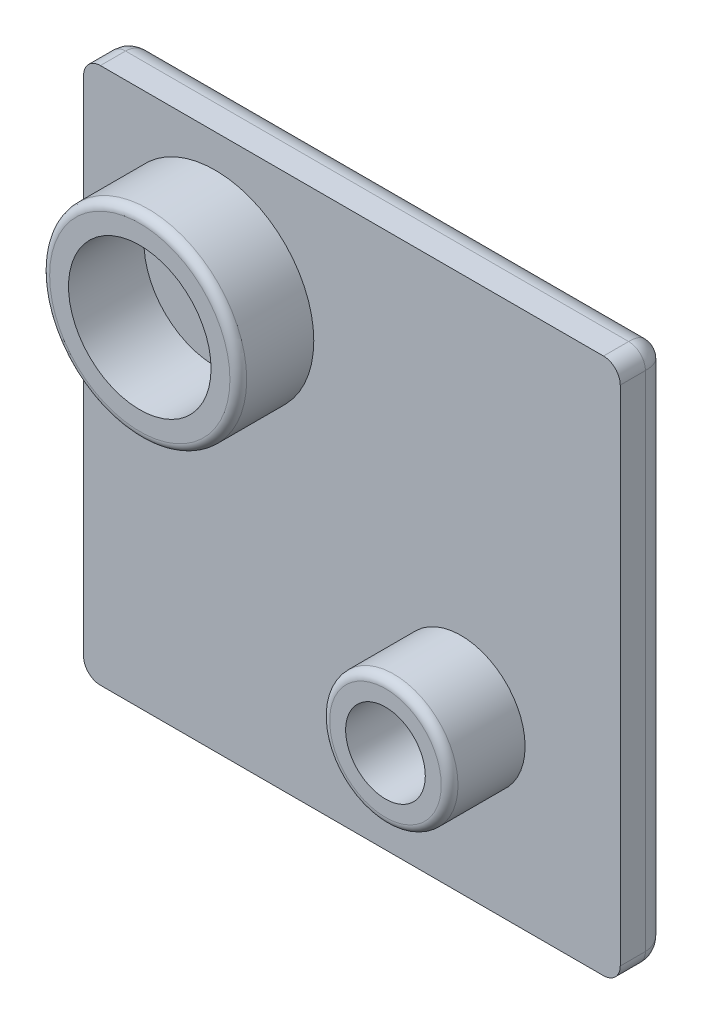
ISO-10303-21;
HEADER;
FILE_DESCRIPTION(('STEP AP214'),'2;1');
FILE_NAME('part.step','',(''),(''),'','','');
FILE_SCHEMA(('AUTOMOTIVE_DESIGN { 1 0 10303 214 1 1 1 1 }'));
ENDSEC;
DATA;
#1=APPLICATION_CONTEXT('core data for automotive mechanical design processes');
#2=APPLICATION_PROTOCOL_DEFINITION('international standard','automotive_design',2000,#1);
#3=PRODUCT_CONTEXT('',#1,'mechanical');
#4=PRODUCT('Part','Part','',(#3));
#5=PRODUCT_RELATED_PRODUCT_CATEGORY('part','',(#4));
#6=PRODUCT_DEFINITION_FORMATION('','',#4);
#7=PRODUCT_DEFINITION_CONTEXT('part definition',#1,'design');
#8=PRODUCT_DEFINITION('design','',#6,#7);
#9=PRODUCT_DEFINITION_SHAPE('','',#8);
#10=(LENGTH_UNIT() NAMED_UNIT(*) SI_UNIT(.MILLI.,.METRE.));
#11=(NAMED_UNIT(*) PLANE_ANGLE_UNIT() SI_UNIT($,.RADIAN.));
#12=(NAMED_UNIT(*) SI_UNIT($,.STERADIAN.) SOLID_ANGLE_UNIT());
#13=UNCERTAINTY_MEASURE_WITH_UNIT(LENGTH_MEASURE(1.E-05),#10,'distance_accuracy_value','');
#14=(GEOMETRIC_REPRESENTATION_CONTEXT(3) GLOBAL_UNCERTAINTY_ASSIGNED_CONTEXT((#13)) GLOBAL_UNIT_ASSIGNED_CONTEXT((#10,
#11,#12)) REPRESENTATION_CONTEXT('',''));
#15=CARTESIAN_POINT('',(0.,0.,0.));
#16=DIRECTION('',(0.,0.,1.));
#17=DIRECTION('',(1.,0.,0.));
#18=AXIS2_PLACEMENT_3D('',#15,#16,#17);
#19=CARTESIAN_POINT('',(-6.5,6.5,3.));
#20=DIRECTION('',(0.,0.,1.));
#21=DIRECTION('',(1.,0.,0.));
#22=AXIS2_PLACEMENT_3D('',#19,#20,#21);
#23=PLANE('',#22);
#24=CARTESIAN_POINT('',(-14.65,14.65,3.));
#25=DIRECTION('',(0.,0.,1.));
#26=DIRECTION('',(1.,0.,0.));
#27=AXIS2_PLACEMENT_3D('',#24,#25,#26);
#28=CIRCLE('',#27,4.25);
#29=CARTESIAN_POINT('',(-10.4,14.65,3.));
#30=VERTEX_POINT('',#29);
#31=EDGE_CURVE('E41',#30,#30,#28,.T.);
#32=ORIENTED_EDGE('',*,*,#31,.T.);
#33=EDGE_LOOP('',(#32));
#34=FACE_BOUND('',#33,.T.);
#35=ADVANCED_FACE('F34',(#34),#23,.T.);
#36=CARTESIAN_POINT('',(-14.65,14.65,3.));
#37=DIRECTION('',(0.,0.,1.));
#38=DIRECTION('',(1.,0.,0.));
#39=AXIS2_PLACEMENT_3D('',#36,#37,#38);
#40=CYLINDRICAL_SURFACE('',#39,4.25);
#41=ORIENTED_EDGE('',*,*,#31,.F.);
#42=EDGE_LOOP('',(#41));
#43=FACE_BOUND('',#42,.T.);
#44=CARTESIAN_POINT('',(-14.65,14.65,7.5));
#45=DIRECTION('',(0.,0.,1.));
#46=DIRECTION('',(1.,0.,0.));
#47=AXIS2_PLACEMENT_3D('',#44,#45,#46);
#48=CIRCLE('',#47,4.25);
#49=CARTESIAN_POINT('',(-10.4,14.65,7.5));
#50=VERTEX_POINT('',#49);
#51=EDGE_CURVE('E429',#50,#50,#48,.T.);
#52=ORIENTED_EDGE('',*,*,#51,.T.);
#53=EDGE_LOOP('',(#52));
#54=FACE_BOUND('',#53,.T.);
#55=ADVANCED_FACE('F240',(#43,#54),#40,.F.);
#56=CARTESIAN_POINT('',(0.,0.,3.));
#57=DIRECTION('',(0.,0.,1.));
#58=DIRECTION('',(1.,0.,0.));
#59=AXIS2_PLACEMENT_3D('',#56,#57,#58);
#60=CYLINDRICAL_SURFACE('',#59,2.375);
#61=CARTESIAN_POINT('',(0.,0.,7.5));
#62=DIRECTION('',(0.,0.,1.));
#63=DIRECTION('',(1.,0.,0.));
#64=AXIS2_PLACEMENT_3D('',#61,#62,#63);
#65=CIRCLE('',#64,2.375);
#66=CARTESIAN_POINT('',(2.375,0.,7.5));
#67=VERTEX_POINT('',#66);
#68=EDGE_CURVE('E430',#67,#67,#65,.T.);
#69=ORIENTED_EDGE('',*,*,#68,.T.);
#70=EDGE_LOOP('',(#69));
#71=FACE_BOUND('',#70,.T.);
#72=CARTESIAN_POINT('',(0.,0.,0.));
#73=DIRECTION('',(0.,0.,-1.));
#74=DIRECTION('',(-1.,0.,0.));
#75=AXIS2_PLACEMENT_3D('',#72,#73,#74);
#76=CIRCLE('',#75,2.375);
#77=CARTESIAN_POINT('',(-2.375,0.,0.));
#78=VERTEX_POINT('',#77);
#79=EDGE_CURVE('E420',#78,#78,#76,.T.);
#80=ORIENTED_EDGE('',*,*,#79,.T.);
#81=EDGE_LOOP('',(#80));
#82=FACE_BOUND('',#81,.T.);
#83=ADVANCED_FACE('F237',(#71,#82),#60,.F.);
#84=CARTESIAN_POINT('',(8.5,-9.5,1.5));
#85=CARTESIAN_POINT('',(8.64959965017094,-9.5,1.5));
#86=CARTESIAN_POINT('',(8.87382526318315,-9.44864904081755,1.5));
#87=CARTESIAN_POINT('',(9.12869530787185,-9.28832458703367,1.5));
#88=CARTESIAN_POINT('',(9.31506766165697,-9.10215615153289,1.5));
#89=CARTESIAN_POINT('',(9.4618756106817,-8.83656565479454,1.5));
#90=CARTESIAN_POINT('',(9.5,-8.61219973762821,1.5));
#91=CARTESIAN_POINT('',(9.5,-8.5,1.5));
#92=CARTESIAN_POINT('',(8.5,-9.5,1.3878002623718));
#93=CARTESIAN_POINT('',(8.64959965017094,-9.5,1.37658483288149));
#94=CARTESIAN_POINT('',(8.87382526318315,-9.44864904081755,1.36367698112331));
#95=CARTESIAN_POINT('',(9.12869530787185,-9.28832458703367,1.3565996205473));
#96=CARTESIAN_POINT('',(9.31506766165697,-9.10215615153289,1.35658888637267));
#97=CARTESIAN_POINT('',(9.4618756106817,-8.83656565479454,1.36547403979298));
#98=CARTESIAN_POINT('',(9.5,-8.61219973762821,1.37940636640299));
#99=CARTESIAN_POINT('',(9.5,-8.5,1.38780026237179));
#100=CARTESIAN_POINT('',(8.49158650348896,-9.47475951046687,1.16337706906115));
#101=CARTESIAN_POINT('',(8.63516135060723,-9.46930415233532,1.1299187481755));
#102=CARTESIAN_POINT('',(8.85036280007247,-9.41297735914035,1.09141329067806));
#103=CARTESIAN_POINT('',(9.09701167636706,-9.25312402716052,1.07032381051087));
#104=CARTESIAN_POINT('',(9.27925701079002,-9.07104964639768,1.070288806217));
#105=CARTESIAN_POINT('',(9.42670608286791,-8.81459243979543,1.09676856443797));
#106=CARTESIAN_POINT('',(9.47064634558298,-8.59926245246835,1.13832159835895));
#107=CARTESIAN_POINT('',(9.47475951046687,-8.49158650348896,1.16337706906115));
#108=CARTESIAN_POINT('',(8.45427085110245,-9.36281255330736,0.843743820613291));
#109=CARTESIAN_POINT('',(8.57575277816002,-9.33968736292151,0.793195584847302));
#110=CARTESIAN_POINT('',(8.75791879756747,-9.26913659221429,0.73583875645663));
#111=CARTESIAN_POINT('',(8.97313452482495,-9.11451849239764,0.704586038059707));
#112=CARTESIAN_POINT('',(9.13816191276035,-8.94960245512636,0.704544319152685));
#113=CARTESIAN_POINT('',(9.28410005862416,-8.72760788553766,0.743751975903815));
#114=CARTESIAN_POINT('',(9.34550425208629,-8.54539344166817,0.805881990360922));
#115=CARTESIAN_POINT('',(9.36281255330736,-8.45427085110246,0.843743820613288));
#116=CARTESIAN_POINT('',(8.3742557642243,-9.1227672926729,0.46112464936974));
#117=CARTESIAN_POINT('',(8.45970020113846,-9.07870364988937,0.413738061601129));
#118=CARTESIAN_POINT('',(8.58789303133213,-8.99607577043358,0.361381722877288));
#119=CARTESIAN_POINT('',(8.74808104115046,-8.86027726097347,0.333150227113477));
#120=CARTESIAN_POINT('',(8.87900866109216,-8.729387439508,0.333127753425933));
#121=CARTESIAN_POINT('',(9.01129794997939,-8.5665327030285,0.368489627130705));
#122=CARTESIAN_POINT('',(9.08978549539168,-8.43835714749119,0.425601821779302));
#123=CARTESIAN_POINT('',(9.12276729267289,-8.37425576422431,0.461124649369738));
#124=CARTESIAN_POINT('',(8.22438191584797,-8.67314574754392,0.102425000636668));
#125=CARTESIAN_POINT('',(8.26694263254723,-8.630204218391,0.088230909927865));
#126=CARTESIAN_POINT('',(8.33081031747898,-8.56589591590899,0.073244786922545));
#127=CARTESIAN_POINT('',(8.41613789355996,-8.480239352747,0.065312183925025));
#128=CARTESIAN_POINT('',(8.49093508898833,-8.40545388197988,0.065313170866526));
#129=CARTESIAN_POINT('',(8.57662562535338,-8.32016284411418,0.075221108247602));
#130=CARTESIAN_POINT('',(8.64098697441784,-8.25631425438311,0.091766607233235));
#131=CARTESIAN_POINT('',(8.67314574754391,-8.22438191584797,0.102425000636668));
#132=CARTESIAN_POINT('',(8.07479982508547,-8.22439947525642,0.));
#133=CARTESIAN_POINT('',(8.08904741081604,-8.21015188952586,0.));
#134=CARTESIAN_POINT('',(8.11041878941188,-8.18878051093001,0.));
#135=CARTESIAN_POINT('',(8.13891396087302,-8.16028533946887,0.));
#136=CARTESIAN_POINT('',(8.16384723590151,-8.13535206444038,0.));
#137=CARTESIAN_POINT('',(8.19234240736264,-8.10685689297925,0.));
#138=CARTESIAN_POINT('',(8.21371378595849,-8.0854855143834,0.));
#139=CARTESIAN_POINT('',(8.22439947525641,-8.07479982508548,0.));
#140=CARTESIAN_POINT('',(8.,-8.00000000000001,0.));
#141=CARTESIAN_POINT('',(8.,-8.00000000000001,0.));
#142=CARTESIAN_POINT('',(8.,-8.00000000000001,0.));
#143=CARTESIAN_POINT('',(8.,-8.00000000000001,0.));
#144=CARTESIAN_POINT('',(8.,-8.00000000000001,0.));
#145=CARTESIAN_POINT('',(8.,-8.00000000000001,0.));
#146=CARTESIAN_POINT('',(8.,-8.00000000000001,0.));
#147=CARTESIAN_POINT('',(8.,-8.00000000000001,0.));
#148=B_SPLINE_SURFACE_WITH_KNOTS('',3,3,((#84,#85,#86,#87,#88,#89,#90,#91),(#92,#93,#94,#95,#96,
#97,#98,#99),(#100,#101,#102,#103,#104,#105,#106,#107),(#108,#109,#110,#111,#112,#113,#114,
#115),(#116,#117,#118,#119,#120,#121,#122,#123),(#124,#125,#126,#127,#128,#129,#130,#131),(#132,
#133,#134,#135,#136,#137,#138,#139),(#140,#141,#142,#143,#144,#145,#146,#147)),.UNSPECIFIED.,
.F.,.F.,.F.,(4,1,1,1,1,4),(4,1,1,1,1,4),(0.,0.224399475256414,0.448798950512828,
0.673198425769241,1.12199737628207,1.5707963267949),(0.,0.285714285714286,0.428571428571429,
0.571428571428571,0.785714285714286,1.),.UNSPECIFIED.);
#149=CARTESIAN_POINT('',(8.,-8.00000000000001,0.));
#150=CARTESIAN_POINT('',(8.22439947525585,-8.07479982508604,0.));
#151=CARTESIAN_POINT('',(8.67314574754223,-8.22438191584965,0.102425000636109));
#152=CARTESIAN_POINT('',(9.12276729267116,-8.37425576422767,0.461124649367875));
#153=CARTESIAN_POINT('',(9.36281255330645,-8.45427085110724,0.843743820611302));
#154=CARTESIAN_POINT('',(9.47475951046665,-8.49158650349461,1.16337706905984));
#155=CARTESIAN_POINT('',(9.5,-8.50000000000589,1.38780026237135));
#156=CARTESIAN_POINT('',(9.5,-8.50000000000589,1.5));
#157=B_SPLINE_CURVE_WITH_KNOTS('',3,(#149,#150,#151,#152,#153,#154,#155,#156),.UNSPECIFIED.,.F.,
.F.,(4,1,1,1,1,4),(0.,0.448798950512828,0.897597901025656,1.12199737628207,1.34639685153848,
1.5707963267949),.UNSPECIFIED.);
#158=CARTESIAN_POINT('',(9.5,-8.5,1.5));
#159=VERTEX_POINT('',#158);
#160=CARTESIAN_POINT('',(8.,-8.,0.));
#161=VERTEX_POINT('',#160);
#162=EDGE_CURVE('E132',#159,#161,#157,.F.);
#163=CARTESIAN_POINT('',(9.5,-8.5,1.5));
#164=CARTESIAN_POINT('',(9.50000000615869,-8.5130898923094,1.5));
#165=CARTESIAN_POINT('',(9.49974054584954,-8.52617966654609,1.5));
#166=CARTESIAN_POINT('',(9.49870609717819,-8.55233882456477,1.5));
#167=CARTESIAN_POINT('',(9.49793110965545,-8.56540820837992,1.5));
#168=CARTESIAN_POINT('',(9.49586900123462,-8.59150660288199,1.5));
#169=CARTESIAN_POINT('',(9.4945818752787,-8.6045356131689,1.5));
#170=CARTESIAN_POINT('',(9.49149888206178,-8.63053336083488,1.5));
#171=CARTESIAN_POINT('',(9.48970301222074,-8.64350209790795,1.5));
#172=CARTESIAN_POINT('',(9.48560590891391,-8.66935937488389,1.5));
#173=CARTESIAN_POINT('',(9.48330467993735,-8.68224791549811,1.5));
#174=CARTESIAN_POINT('',(9.47820024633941,-8.70792488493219,1.5));
#175=CARTESIAN_POINT('',(9.47539705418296,-8.72071331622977,1.5));
#176=CARTESIAN_POINT('',(9.46929202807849,-8.74617013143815,1.5));
#177=CARTESIAN_POINT('',(9.46599021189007,-8.75883851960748,1.5));
#178=CARTESIAN_POINT('',(9.45889147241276,-8.7840353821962,1.5));
#179=CARTESIAN_POINT('',(9.45509456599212,-8.79656386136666,1.5));
#180=CARTESIAN_POINT('',(9.44700844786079,-8.8214607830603,1.5));
#181=CARTESIAN_POINT('',(9.44271924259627,-8.83382922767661,1.5));
#182=CARTESIAN_POINT('',(9.43365465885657,-8.85838694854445,1.5));
#183=CARTESIAN_POINT('',(9.4288792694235,-8.8705762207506,1.5));
#184=CARTESIAN_POINT('',(9.41885287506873,-8.89475808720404,1.5));
#185=CARTESIAN_POINT('',(9.41360185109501,-8.90675067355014,1.5));
#186=CARTESIAN_POINT('',(9.40263385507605,-8.93052136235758,1.5));
#187=CARTESIAN_POINT('',(9.39691686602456,-8.94229945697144,1.5));
#188=CARTESIAN_POINT('',(9.38502683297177,-8.9656234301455,1.5));
#189=CARTESIAN_POINT('',(9.37885378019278,-8.97716930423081,1.5));
#190=CARTESIAN_POINT('',(9.36606144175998,-9.0000110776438,1.5));
#191=CARTESIAN_POINT('',(9.35944215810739,-9.01130697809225,1.5));
#192=CARTESIAN_POINT('',(9.34576720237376,-9.03363105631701,1.5));
#193=CARTESIAN_POINT('',(9.3387115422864,-9.04465924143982,1.5));
#194=CARTESIAN_POINT('',(9.32417364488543,-9.06643011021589,1.5));
#195=CARTESIAN_POINT('',(9.31669142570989,-9.07717280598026,1.5));
#196=CARTESIAN_POINT('',(9.30131033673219,-9.09835502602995,1.5));
#197=CARTESIAN_POINT('',(9.29341148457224,-9.10879456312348,1.5));
#198=CARTESIAN_POINT('',(9.27720664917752,-9.12935240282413,1.5));
#199=CARTESIAN_POINT('',(9.26890067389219,-9.13947071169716,1.5));
#200=CARTESIAN_POINT('',(9.25189595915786,-9.15937193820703,1.5));
#201=CARTESIAN_POINT('',(9.24319721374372,-9.16915485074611,1.5));
#202=CARTESIAN_POINT('',(9.22542194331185,-9.18837180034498,1.5));
#203=CARTESIAN_POINT('',(9.21634540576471,-9.19780582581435,1.5));
#204=CARTESIAN_POINT('',(9.19782934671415,-9.21631134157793,1.5));
#205=CARTESIAN_POINT('',(9.18838981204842,-9.22538281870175,1.5));
#206=CARTESIAN_POINT('',(9.16916261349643,-9.24314963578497,1.5));
#207=CARTESIAN_POINT('',(9.1593749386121,-9.25184496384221,1.5));
#208=CARTESIAN_POINT('',(9.13946623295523,-9.26884579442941,1.5));
#209=CARTESIAN_POINT('',(9.12934519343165,-9.27715128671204,1.5));
#210=CARTESIAN_POINT('',(9.10878486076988,-9.29335897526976,1.5));
#211=CARTESIAN_POINT('',(9.09834556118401,-9.30126116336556,1.5));
#212=CARTESIAN_POINT('',(9.077165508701,-9.31665060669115,1.5));
#213=CARTESIAN_POINT('',(9.06642475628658,-9.32413786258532,1.5));
#214=CARTESIAN_POINT('',(9.0446584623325,-9.33868562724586,1.5));
#215=CARTESIAN_POINT('',(9.03363292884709,-9.34574614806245,1.5));
#216=CARTESIAN_POINT('',(9.01131375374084,-9.35942861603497,1.5));
#217=CARTESIAN_POINT('',(9.00002012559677,-9.36605058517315,1.5));
#218=CARTESIAN_POINT('',(8.97718153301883,-9.37884431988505,1.5));
#219=CARTESIAN_POINT('',(8.96563658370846,-9.38501611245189,1.5));
#220=CARTESIAN_POINT('',(8.94231174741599,-9.39689710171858,1.5));
#221=CARTESIAN_POINT('',(8.93053187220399,-9.40260632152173,1.5));
#222=CARTESIAN_POINT('',(8.90675517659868,-9.41355322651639,1.5));
#223=CARTESIAN_POINT('',(8.89475835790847,-9.41879091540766,1.5));
#224=CARTESIAN_POINT('',(8.87056768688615,-9.42879065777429,1.5));
#225=CARTESIAN_POINT('',(8.8583738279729,-9.43355269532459,1.5));
#226=CARTESIAN_POINT('',(8.83380851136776,-9.44259612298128,1.5));
#227=CARTESIAN_POINT('',(8.821437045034,-9.44687748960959,1.5));
#228=CARTESIAN_POINT('',(8.79653606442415,-9.45495479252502,1.5));
#229=CARTESIAN_POINT('',(8.78400654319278,-9.45875070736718,1.5));
#230=CARTESIAN_POINT('',(8.75880896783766,-9.4658522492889,1.5));
#231=CARTESIAN_POINT('',(8.74614091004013,-9.46915786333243,1.5));
#232=CARTESIAN_POINT('',(8.72068578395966,-9.47527395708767,1.5));
#233=CARTESIAN_POINT('',(8.70789871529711,-9.47808443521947,1.5));
#234=CARTESIAN_POINT('',(8.68222508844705,-9.48320540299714,1.5));
#235=CARTESIAN_POINT('',(8.66933853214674,-9.48551590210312,1.5));
#236=CARTESIAN_POINT('',(8.64348545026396,-9.48963205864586,1.5));
#237=CARTESIAN_POINT('',(8.63051892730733,-9.49143773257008,1.5));
#238=CARTESIAN_POINT('',(8.60452544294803,-9.49453939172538,1.5));
#239=CARTESIAN_POINT('',(8.59149848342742,-9.49583539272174,1.5));
#240=CARTESIAN_POINT('',(8.56540362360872,-9.49791285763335,1.5));
#241=CARTESIAN_POINT('',(8.55233572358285,-9.49869432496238,1.5));
#242=CARTESIAN_POINT('',(8.52617860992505,-9.49973792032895,1.5));
#243=CARTESIAN_POINT('',(8.51308939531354,-9.50000002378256,1.5));
#244=CARTESIAN_POINT('',(8.5,-9.5,1.5));
#245=B_SPLINE_CURVE_WITH_KNOTS('',3,(#163,#164,#165,#166,#167,#168,#169,#170,#171,#172,#173,
#174,#175,#176,#177,#178,#179,#180,#181,#182,#183,#184,#185,#186,#187,#188,#189,#190,#191,#192,
#193,#194,#195,#196,#197,#198,#199,#200,#201,#202,#203,#204,#205,#206,#207,#208,#209,#210,#211,
#212,#213,#214,#215,#216,#217,#218,#219,#220,#221,#222,#223,#224,#225,#226,#227,#228,#229,#230,
#231,#232,#233,#234,#235,#236,#237,#238,#239,#240,#241,#242,#243,#244),.UNSPECIFIED.,.F.,.F.,(4,
2,2,2,2,2,2,2,2,2,2,2,2,2,2,2,2,2,2,2,2,2,2,2,2,2,2,2,2,2,2,2,2,2,2,2,2,2,2,2,4),(0.,
0.0392669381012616,0.0785338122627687,0.117801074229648,0.157068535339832,0.196335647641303,
0.235601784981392,0.274866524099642,0.314129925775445,0.353392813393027,0.392656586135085,
0.431921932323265,0.471188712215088,0.510456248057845,0.549723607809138,0.588989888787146,
0.628254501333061,0.667517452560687,0.706779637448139,0.746042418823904,0.785306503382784,
0.82457201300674,0.863838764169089,0.903106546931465,0.942375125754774,0.981643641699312,
1.02091104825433,1.06017648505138,1.09943956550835,1.13870068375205,1.17796149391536,
1.21722361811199,1.25648765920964,1.2957534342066,1.33502025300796,1.37428719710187,
1.41355339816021,1.45281831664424,1.49208202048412,1.53134546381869,1.57061076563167),.UNSPECIFIED.);
#246=CARTESIAN_POINT('',(8.5,-9.5,1.5));
#247=VERTEX_POINT('',#246);
#248=EDGE_CURVE('E115',#159,#247,#245,.T.);
#249=CARTESIAN_POINT('',(8.5,-9.5,1.5));
#250=CARTESIAN_POINT('',(8.50000002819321,-9.50000008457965,1.48036408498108));
#251=CARTESIAN_POINT('',(8.49987115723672,-9.49961347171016,1.46072828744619));
#252=CARTESIAN_POINT('',(8.49935677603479,-9.49807032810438,1.42148645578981));
#253=CARTESIAN_POINT('',(8.49897121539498,-9.49691364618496,1.40188042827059));
#254=CARTESIAN_POINT('',(8.49794443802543,-9.49383331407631,1.36272866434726));
#255=CARTESIAN_POINT('',(8.4973031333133,-9.4919093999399,1.34318295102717));
#256=CARTESIAN_POINT('',(8.49576587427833,-9.487297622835,1.30418226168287));
#257=CARTESIAN_POINT('',(8.49486979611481,-9.48460938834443,1.28472733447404));
#258=CARTESIAN_POINT('',(8.49282403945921,-9.47847211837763,1.24593863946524));
#259=CARTESIAN_POINT('',(8.49167420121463,-9.4750226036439,1.22660495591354));
#260=CARTESIAN_POINT('',(8.48912176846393,-9.4673653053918,1.18808929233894));
#261=CARTESIAN_POINT('',(8.4877189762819,-9.46315692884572,1.16890744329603));
#262=CARTESIAN_POINT('',(8.4846623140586,-9.4539869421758,1.13072534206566));
#263=CARTESIAN_POINT('',(8.48300820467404,-9.44902461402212,1.11172528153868));
#264=CARTESIAN_POINT('',(8.47945279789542,-9.43835839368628,1.07393452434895));
#265=CARTESIAN_POINT('',(8.47755122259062,-9.43265366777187,1.05514408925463));
#266=CARTESIAN_POINT('',(8.4735044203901,-9.42051326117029,1.01780051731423));
#267=CARTESIAN_POINT('',(8.47135888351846,-9.41407665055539,0.999247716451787));
#268=CARTESIAN_POINT('',(8.4668277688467,-9.40048330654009,0.962407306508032));
#269=CARTESIAN_POINT('',(8.46444185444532,-9.39332556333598,0.944120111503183));
#270=CARTESIAN_POINT('',(8.45943360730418,-9.37830082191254,0.907838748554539));
#271=CARTESIAN_POINT('',(8.45681091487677,-9.37043274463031,0.889845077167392));
#272=CARTESIAN_POINT('',(8.45133258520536,-9.35399775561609,0.854178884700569));
#273=CARTESIAN_POINT('',(8.44847656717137,-9.34542970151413,0.836506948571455));
#274=CARTESIAN_POINT('',(8.44253596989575,-9.32760790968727,0.801511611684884));
#275=CARTESIAN_POINT('',(8.4394509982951,-9.3183529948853,0.7841888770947));
#276=CARTESIAN_POINT('',(8.43305751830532,-9.29917255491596,0.749918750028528));
#277=CARTESIAN_POINT('',(8.42974861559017,-9.2892458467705,0.732972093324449));
#278=CARTESIAN_POINT('',(8.4229121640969,-9.26873649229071,0.69948115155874));
#279=CARTESIAN_POINT('',(8.41938422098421,-9.25815266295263,0.682937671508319));
#280=CARTESIAN_POINT('',(8.41211459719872,-9.23634379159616,0.650280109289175));
#281=CARTESIAN_POINT('',(8.4083725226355,-9.22511756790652,0.634166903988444));
#282=CARTESIAN_POINT('',(8.40067959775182,-9.20203879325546,0.602396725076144));
#283=CARTESIAN_POINT('',(8.39672835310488,-9.19018505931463,0.58674070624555));
#284=CARTESIAN_POINT('',(8.38862181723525,-9.16586545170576,0.555912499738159));
#285=CARTESIAN_POINT('',(8.38446612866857,-9.15339838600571,0.540741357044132));
#286=CARTESIAN_POINT('',(8.37595828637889,-9.12787485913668,0.510902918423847));
#287=CARTESIAN_POINT('',(8.37160573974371,-9.11481721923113,0.496236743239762));
#288=CARTESIAN_POINT('',(8.36271211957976,-9.08813635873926,0.467426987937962));
#289=CARTESIAN_POINT('',(8.35817066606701,-9.07451199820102,0.453284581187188));
#290=CARTESIAN_POINT('',(8.34890706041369,-9.04672118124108,0.425541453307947));
#291=CARTESIAN_POINT('',(8.34418454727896,-9.03255364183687,0.41194193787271));
#292=CARTESIAN_POINT('',(8.33456667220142,-9.00370001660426,0.385303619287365));
#293=CARTESIAN_POINT('',(8.32967097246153,-8.9890129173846,0.372266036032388));
#294=CARTESIAN_POINT('',(8.31971456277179,-8.95914368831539,0.346770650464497));
#295=CARTESIAN_POINT('',(8.31465354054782,-8.94396062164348,0.334314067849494));
#296=CARTESIAN_POINT('',(8.30437432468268,-8.91312297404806,0.309999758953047));
#297=CARTESIAN_POINT('',(8.29915584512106,-8.89746753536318,0.298143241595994));
#298=CARTESIAN_POINT('',(8.28856955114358,-8.86570865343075,0.275048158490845));
#299=CARTESIAN_POINT('',(8.28320147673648,-8.84960443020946,0.263810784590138));
#300=CARTESIAN_POINT('',(8.27232383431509,-8.81697150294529,0.241973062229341));
#301=CARTESIAN_POINT('',(8.26681403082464,-8.80044209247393,0.231373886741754));
#302=CARTESIAN_POINT('',(8.25566075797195,-8.76698227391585,0.210831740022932));
#303=CARTESIAN_POINT('',(8.2500170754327,-8.75005122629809,0.200889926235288));
#304=CARTESIAN_POINT('',(8.23860393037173,-8.71581179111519,0.181681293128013));
#305=CARTESIAN_POINT('',(8.23283427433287,-8.69850282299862,0.172415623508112));
#306=CARTESIAN_POINT('',(8.22117686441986,-8.66353059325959,0.154579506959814));
#307=CARTESIAN_POINT('',(8.21528893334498,-8.64586680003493,0.146010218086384));
#308=CARTESIAN_POINT('',(8.20340375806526,-8.61021127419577,0.129580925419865));
#309=CARTESIAN_POINT('',(8.19740635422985,-8.59221906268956,0.121722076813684));
#310=CARTESIAN_POINT('',(8.18531233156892,-8.55593699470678,0.106719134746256));
#311=CARTESIAN_POINT('',(8.17921557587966,-8.537646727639,0.0995761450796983));
#312=CARTESIAN_POINT('',(8.16693269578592,-8.50079808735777,0.0860121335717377));
#313=CARTESIAN_POINT('',(8.16074645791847,-8.48223937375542,0.0795921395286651));
#314=CARTESIAN_POINT('',(8.14829452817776,-8.44488358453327,0.0674809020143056));
#315=CARTESIAN_POINT('',(8.14202874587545,-8.42608623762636,0.0617905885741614));
#316=CARTESIAN_POINT('',(8.12942762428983,-8.38828287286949,0.0511456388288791));
#317=CARTESIAN_POINT('',(8.12309221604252,-8.36927664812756,0.0461918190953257));
#318=CARTESIAN_POINT('',(8.11036174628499,-8.33108523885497,0.0370267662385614));
#319=CARTESIAN_POINT('',(8.10396663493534,-8.31189990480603,0.032816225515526));
#320=CARTESIAN_POINT('',(8.09112666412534,-8.27337999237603,0.0251446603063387));
#321=CARTESIAN_POINT('',(8.08468177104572,-8.25404531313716,0.021684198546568));
#322=CARTESIAN_POINT('',(8.0717521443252,-8.21525643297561,0.0155197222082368));
#323=CARTESIAN_POINT('',(8.06526739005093,-8.19580217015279,0.0128161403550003));
#324=CARTESIAN_POINT('',(8.05226795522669,-8.15680386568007,0.00817236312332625));
#325=CARTESIAN_POINT('',(8.04575326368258,-8.13725979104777,0.00623247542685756));
#326=CARTESIAN_POINT('',(8.0327038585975,-8.09811157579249,0.00312299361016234));
#327=CARTESIAN_POINT('',(8.02616914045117,-8.0785074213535,0.00195359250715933));
#328=CARTESIAN_POINT('',(8.01308963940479,-8.03926891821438,0.000392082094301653));
#329=CARTESIAN_POINT('',(8.0065448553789,-8.01963456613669,6.71925660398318E-08));
#330=CARTESIAN_POINT('',(8.,-8.00000000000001,0.));
#331=B_SPLINE_CURVE_WITH_KNOTS('',3,(#249,#250,#251,#252,#253,#254,#255,#256,#257,#258,#259,
#260,#261,#262,#263,#264,#265,#266,#267,#268,#269,#270,#271,#272,#273,#274,#275,#276,#277,#278,
#279,#280,#281,#282,#283,#284,#285,#286,#287,#288,#289,#290,#291,#292,#293,#294,#295,#296,#297,
#298,#299,#300,#301,#302,#303,#304,#305,#306,#307,#308,#309,#310,#311,#312,#313,#314,#315,#316,
#317,#318,#319,#320,#321,#322,#323,#324,#325,#326,#327,#328,#329,#330),.UNSPECIFIED.,.F.,.F.,(4,
2,2,2,2,2,2,2,2,2,2,2,2,2,2,2,2,2,2,2,2,2,2,2,2,2,2,2,2,2,2,2,2,2,2,2,2,2,2,2,4),(0.,
0.0589033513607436,0.117818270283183,0.176753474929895,0.235717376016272,0.294718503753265,
0.353765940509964,0.412869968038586,0.472040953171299,0.531287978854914,0.590619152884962,
0.650042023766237,0.709563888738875,0.769190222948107,0.828924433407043,0.88876948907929,
0.948728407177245,1.00880469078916,1.06900274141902,1.12932675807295,1.18977861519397,
1.25035800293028,1.31106288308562,1.37188993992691,1.43283502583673,1.49389360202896,
1.55506117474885,1.61633372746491,1.67770814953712,1.73918263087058,1.80075533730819,
1.86242156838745,1.92417438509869,1.98600514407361,2.04790395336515,2.10986012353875,
2.17186261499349,2.23390048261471,2.29596331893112,2.3580416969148,2.4201276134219),.UNSPECIFIED.);
#332=EDGE_CURVE('E137',#161,#247,#331,.F.);
#333=ORIENTED_EDGE('',*,*,#162,.F.);
#334=ORIENTED_EDGE('',*,*,#248,.T.);
#335=ORIENTED_EDGE('',*,*,#332,.F.);
#336=EDGE_LOOP('',(#333,#334,#335));
#337=FACE_BOUND('',#336,.T.);
#338=ADVANCED_FACE('F135',(#337),#148,.T.);
#339=CARTESIAN_POINT('',(9.5,21.5,1.5));
#340=CARTESIAN_POINT('',(9.5,21.6495996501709,1.5));
#341=CARTESIAN_POINT('',(9.44864553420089,21.8738214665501,1.5));
#342=CARTESIAN_POINT('',(9.28832748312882,22.1287026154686,1.5));
#343=CARTESIAN_POINT('',(9.10215322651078,22.3150646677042,1.5));
#344=CARTESIAN_POINT('',(8.83656581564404,22.4618772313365,1.5));
#345=CARTESIAN_POINT('',(8.61219973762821,22.5,1.5));
#346=CARTESIAN_POINT('',(8.50000000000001,22.5,1.5));
#347=CARTESIAN_POINT('',(9.5,21.5,1.3878002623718));
#348=CARTESIAN_POINT('',(9.5,21.6495996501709,1.3765841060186));
#349=CARTESIAN_POINT('',(9.44864553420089,21.8738214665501,1.36367785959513));
#350=CARTESIAN_POINT('',(9.28832748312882,22.1287026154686,1.35659921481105));
#351=CARTESIAN_POINT('',(9.10215322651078,22.3150646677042,1.3565890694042));
#352=CARTESIAN_POINT('',(8.83656581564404,22.4618772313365,1.36547389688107));
#353=CARTESIAN_POINT('',(8.61219973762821,22.5,1.37940644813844));
#354=CARTESIAN_POINT('',(8.50000000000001,22.5,1.38780026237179));
#355=CARTESIAN_POINT('',(9.47476072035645,21.4915869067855,1.163380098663));
#356=CARTESIAN_POINT('',(9.46929669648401,21.6351581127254,1.12990891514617));
#357=CARTESIAN_POINT('',(9.4129652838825,21.8503523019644,1.09140918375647));
#358=CARTESIAN_POINT('',(9.25311469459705,22.0970070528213,1.07031256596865));
#359=CARTESIAN_POINT('',(9.07103700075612,22.2792434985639,1.07028071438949));
#360=CARTESIAN_POINT('',(8.81458595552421,22.4266996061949,1.09676198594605));
#361=CARTESIAN_POINT('',(8.59926085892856,22.4706437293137,1.13832083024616));
#362=CARTESIAN_POINT('',(8.49158690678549,22.4747607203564,1.163380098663));
#363=CARTESIAN_POINT('',(9.36281472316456,21.4542715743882,0.843748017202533));
#364=CARTESIAN_POINT('',(9.33967416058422,21.5757474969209,0.793183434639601));
#365=CARTESIAN_POINT('',(9.2691248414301,21.7579074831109,0.735831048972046));
#366=CARTESIAN_POINT('',(9.1145041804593,21.9731253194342,0.704568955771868));
#367=CARTESIAN_POINT('',(8.94958719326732,22.1381455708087,0.704530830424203));
#368=CARTESIAN_POINT('',(8.72759901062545,22.28409095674,0.743741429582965));
#369=CARTESIAN_POINT('',(8.54539176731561,22.3455013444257,0.805880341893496));
#370=CARTESIAN_POINT('',(8.45427157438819,22.3628147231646,0.843748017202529));
#371=CARTESIAN_POINT('',(9.12276814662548,21.3742560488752,0.461132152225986));
#372=CARTESIAN_POINT('',(9.07868564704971,21.4596938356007,0.413727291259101));
#373=CARTESIAN_POINT('',(8.99606753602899,21.5878836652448,0.361368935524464));
#374=CARTESIAN_POINT('',(8.86026237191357,21.7480706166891,0.333128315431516));
#375=CARTESIAN_POINT('',(8.72937415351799,21.8789945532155,0.333108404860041));
#376=CARTESIAN_POINT('',(8.56652382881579,22.0112894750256,0.368476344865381));
#377=CARTESIAN_POINT('',(8.43835563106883,22.0897821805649,0.425600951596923));
#378=CARTESIAN_POINT('',(8.37425604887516,22.1227681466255,0.461132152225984));
#379=CARTESIAN_POINT('',(8.67314741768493,21.2243824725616,0.102440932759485));
#380=CARTESIAN_POINT('',(8.63018395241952,21.2669351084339,0.088227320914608));
#381=CARTESIAN_POINT('',(8.56588323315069,21.3307975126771,0.073227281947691));
#382=CARTESIAN_POINT('',(8.48021816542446,21.4161207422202,0.065286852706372));
#383=CARTESIAN_POINT('',(8.40543559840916,21.4909156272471,0.065288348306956));
#384=CARTESIAN_POINT('',(8.32015056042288,21.5766129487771,0.075205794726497));
#385=CARTESIAN_POINT('',(8.25631179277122,21.6409824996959,0.091769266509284));
#386=CARTESIAN_POINT('',(8.22438247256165,21.6731474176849,0.102440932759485));
#387=CARTESIAN_POINT('',(8.22439947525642,21.0747998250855,0.));
#388=CARTESIAN_POINT('',(8.21015188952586,21.089047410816,0.));
#389=CARTESIAN_POINT('',(8.18878051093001,21.1104187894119,0.));
#390=CARTESIAN_POINT('',(8.16028533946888,21.138913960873,0.));
#391=CARTESIAN_POINT('',(8.13535206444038,21.1638472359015,0.));
#392=CARTESIAN_POINT('',(8.10685689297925,21.1923424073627,0.));
#393=CARTESIAN_POINT('',(8.0854855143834,21.2137137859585,0.));
#394=CARTESIAN_POINT('',(8.07479982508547,21.2243994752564,0.));
#395=CARTESIAN_POINT('',(8.,21.,0.));
#396=CARTESIAN_POINT('',(8.,21.,0.));
#397=CARTESIAN_POINT('',(8.,21.,0.));
#398=CARTESIAN_POINT('',(8.00000000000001,21.,0.));
#399=CARTESIAN_POINT('',(8.,21.,0.));
#400=CARTESIAN_POINT('',(8.00000000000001,21.,0.));
#401=CARTESIAN_POINT('',(8.,21.,0.));
#402=CARTESIAN_POINT('',(8.,21.,0.));
#403=B_SPLINE_SURFACE_WITH_KNOTS('',3,3,((#339,#340,#341,#342,#343,#344,#345,#346),(#347,#348,
#349,#350,#351,#352,#353,#354),(#355,#356,#357,#358,#359,#360,#361,#362),(#363,#364,#365,#366,
#367,#368,#369,#370),(#371,#372,#373,#374,#375,#376,#377,#378),(#379,#380,#381,#382,#383,#384,
#385,#386),(#387,#388,#389,#390,#391,#392,#393,#394),(#395,#396,#397,#398,#399,#400,#401,#402)),
.UNSPECIFIED.,.F.,.F.,.F.,(4,1,1,1,1,4),(4,1,1,1,1,4),(0.,0.224399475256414,0.448798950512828,
0.673198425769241,1.12199737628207,1.5707963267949),(0.,0.285714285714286,0.428571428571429,
0.571428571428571,0.785714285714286,1.),.UNSPECIFIED.);
#404=CARTESIAN_POINT('',(8.,21.,0.));
#405=CARTESIAN_POINT('',(8.07479982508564,21.2243994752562,0.));
#406=CARTESIAN_POINT('',(8.22438247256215,21.6731474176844,0.102440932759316));
#407=CARTESIAN_POINT('',(8.37425604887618,22.1227681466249,0.461132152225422));
#408=CARTESIAN_POINT('',(8.45427157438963,22.3628147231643,0.84374801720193));
#409=CARTESIAN_POINT('',(8.4915869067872,22.4747607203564,1.1633800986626));
#410=CARTESIAN_POINT('',(8.50000000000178,22.5,1.38780026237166));
#411=CARTESIAN_POINT('',(8.50000000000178,22.5,1.5));
#412=B_SPLINE_CURVE_WITH_KNOTS('',3,(#404,#405,#406,#407,#408,#409,#410,#411),.UNSPECIFIED.,.F.,
.F.,(4,1,1,1,1,4),(0.,0.448798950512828,0.897597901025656,1.12199737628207,1.34639685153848,
1.5707963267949),.UNSPECIFIED.);
#413=CARTESIAN_POINT('',(8.5,22.5,1.5));
#414=VERTEX_POINT('',#413);
#415=CARTESIAN_POINT('',(8.,21.,0.));
#416=VERTEX_POINT('',#415);
#417=EDGE_CURVE('E358',#414,#416,#412,.F.);
#418=CARTESIAN_POINT('',(8.50000000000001,22.5,1.5));
#419=CARTESIAN_POINT('',(8.61219973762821,22.5,1.5));
#420=CARTESIAN_POINT('',(8.83656581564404,22.4618772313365,1.5));
#421=CARTESIAN_POINT('',(9.10215322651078,22.3150646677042,1.5));
#422=CARTESIAN_POINT('',(9.28832748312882,22.1287026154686,1.5));
#423=CARTESIAN_POINT('',(9.44864553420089,21.8738214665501,1.5));
#424=CARTESIAN_POINT('',(9.5,21.6495996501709,1.5));
#425=CARTESIAN_POINT('',(9.5,21.5,1.5));
#426=B_SPLINE_CURVE_WITH_KNOTS('',3,(#418,#419,#420,#421,#422,#423,#424,#425),.UNSPECIFIED.,.F.,
.F.,(4,1,1,1,1,4),(0.,0.214285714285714,0.428571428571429,0.571428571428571,0.714285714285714,
1.),.UNSPECIFIED.);
#427=CARTESIAN_POINT('',(9.5,21.5,1.5));
#428=VERTEX_POINT('',#427);
#429=EDGE_CURVE('E128',#414,#428,#426,.T.);
#430=CARTESIAN_POINT('',(9.5,21.5,1.5));
#431=CARTESIAN_POINT('',(9.50000008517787,21.5000000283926,1.48036412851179));
#432=CARTESIAN_POINT('',(9.49961349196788,21.4998711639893,1.46072837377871));
#433=CARTESIAN_POINT('',(9.49807041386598,21.499356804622,1.42148669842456));
#434=CARTESIAN_POINT('',(9.49691378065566,21.4989712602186,1.40188078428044));
#435=CARTESIAN_POINT('',(9.49383356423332,21.4979445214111,1.36272929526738));
#436=CARTESIAN_POINT('',(9.49190971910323,21.4973032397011,1.34318374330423));
#437=CARTESIAN_POINT('',(9.48729809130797,21.495766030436,1.30418340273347));
#438=CARTESIAN_POINT('',(9.48460993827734,21.4948699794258,1.28472866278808));
#439=CARTESIAN_POINT('',(9.47847283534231,21.4928242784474,1.24594034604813));
#440=CARTESIAN_POINT('',(9.47502340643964,21.4916744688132,1.22660685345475));
#441=CARTESIAN_POINT('',(9.4673662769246,21.4891220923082,1.18809155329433));
#442=CARTESIAN_POINT('',(9.46315798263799,21.487719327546,1.1689098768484));
#443=CARTESIAN_POINT('',(9.45398815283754,21.4846627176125,1.13072809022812));
#444=CARTESIAN_POINT('',(9.44902589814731,21.4830086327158,1.11172817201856));
#445=CARTESIAN_POINT('',(9.43835981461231,21.4794532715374,1.0739376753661));
#446=CARTESIAN_POINT('',(9.43265515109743,21.4775517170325,1.05514735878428));
#447=CARTESIAN_POINT('',(9.42051485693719,21.4735049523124,1.01780400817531));
#448=CARTESIAN_POINT('',(9.41407829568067,21.4713594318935,0.999251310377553));
#449=CARTESIAN_POINT('',(9.40048503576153,21.4668283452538,0.962411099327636));
#450=CARTESIAN_POINT('',(9.39332732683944,21.4644424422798,0.944124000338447));
#451=CARTESIAN_POINT('',(9.37830263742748,21.4594342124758,0.907842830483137));
#452=CARTESIAN_POINT('',(9.37043457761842,21.4568115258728,0.889849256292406));
#453=CARTESIAN_POINT('',(9.35399960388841,21.4513332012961,0.854183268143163));
#454=CARTESIAN_POINT('',(9.34543154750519,21.4484771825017,0.836511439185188));
#455=CARTESIAN_POINT('',(9.32760973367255,21.4425365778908,0.801516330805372));
#456=CARTESIAN_POINT('',(9.31835479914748,21.4394515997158,0.784193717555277));
#457=CARTESIAN_POINT('',(9.29917430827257,21.4330581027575,0.74992384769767));
#458=CARTESIAN_POINT('',(9.2892475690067,21.4297491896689,0.732977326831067));
#459=CARTESIAN_POINT('',(9.26873814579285,21.4229127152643,0.699486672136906));
#460=CARTESIAN_POINT('',(9.25815427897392,21.419384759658,0.682943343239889));
#461=CARTESIAN_POINT('',(9.2363453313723,21.4121151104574,0.650286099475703));
#462=CARTESIAN_POINT('',(9.22511906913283,21.4083730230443,0.634173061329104));
#463=CARTESIAN_POINT('',(9.20204022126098,21.4006800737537,0.602403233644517));
#464=CARTESIAN_POINT('',(9.19018645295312,21.396728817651,0.586747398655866));
#465=CARTESIAN_POINT('',(9.16586678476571,21.3886222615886,0.555919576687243));
#466=CARTESIAN_POINT('',(9.15339969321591,21.3844665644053,0.540748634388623));
#467=CARTESIAN_POINT('',(9.12787612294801,21.3759587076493,0.510910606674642));
#468=CARTESIAN_POINT('',(9.11481846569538,21.3716061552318,0.496244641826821));
#469=CARTESIAN_POINT('',(9.08813757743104,21.3627125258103,0.467435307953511));
#470=CARTESIAN_POINT('',(9.07451320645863,21.3581710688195,0.453293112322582));
#471=CARTESIAN_POINT('',(9.04672237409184,21.3489074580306,0.42555039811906));
#472=CARTESIAN_POINT('',(9.03255482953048,21.3441849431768,0.411951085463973));
#473=CARTESIAN_POINT('',(9.00370119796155,21.3345670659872,0.385313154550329));
#474=CARTESIAN_POINT('',(8.98901409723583,21.3296713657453,0.372275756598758));
#475=CARTESIAN_POINT('',(8.95914486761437,21.3197149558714,0.346780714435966));
#476=CARTESIAN_POINT('',(8.94396180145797,21.3146539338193,0.334324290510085));
#477=CARTESIAN_POINT('',(8.91312415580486,21.3043747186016,0.310010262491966));
#478=CARTESIAN_POINT('',(8.89746871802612,21.299156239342,0.298153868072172));
#479=CARTESIAN_POINT('',(8.86570983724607,21.2885699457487,0.275058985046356));
#480=CARTESIAN_POINT('',(8.8496056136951,21.2832018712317,0.263821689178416));
#481=CARTESIAN_POINT('',(8.81697268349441,21.2723242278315,0.241984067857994));
#482=CARTESIAN_POINT('',(8.80044326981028,21.2668144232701,0.231384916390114));
#483=CARTESIAN_POINT('',(8.76698344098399,21.2556611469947,0.21084275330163));
#484=CARTESIAN_POINT('',(8.75005238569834,21.2500174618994,0.200900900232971));
#485=CARTESIAN_POINT('',(8.71581292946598,21.238604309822,0.181692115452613));
#486=CARTESIAN_POINT('',(8.69850394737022,21.2328346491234,0.172426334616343));
#487=CARTESIAN_POINT('',(8.66353168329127,21.2211772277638,0.154589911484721));
#488=CARTESIAN_POINT('',(8.64586786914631,21.2152892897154,0.146020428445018));
#489=CARTESIAN_POINT('',(8.61021229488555,21.2034040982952,0.129590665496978));
#490=CARTESIAN_POINT('',(8.59222005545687,21.1974066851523,0.121731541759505));
#491=CARTESIAN_POINT('',(8.55593792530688,21.1853126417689,0.106727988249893));
#492=CARTESIAN_POINT('',(8.53764762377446,21.1792158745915,0.0995846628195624));
#493=CARTESIAN_POINT('',(8.50079891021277,21.1669329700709,0.0860199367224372));
#494=CARTESIAN_POINT('',(8.48224015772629,21.1607467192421,0.0795995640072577));
#495=CARTESIAN_POINT('',(8.44488428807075,21.1482947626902,0.0674875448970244));
#496=CARTESIAN_POINT('',(8.42608689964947,21.1420289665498,0.0617968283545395));
#497=CARTESIAN_POINT('',(8.38828345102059,21.1294278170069,0.0511510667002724));
#498=CARTESIAN_POINT('',(8.36927718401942,21.1230923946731,0.0461968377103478));
#499=CARTESIAN_POINT('',(8.33108569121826,21.1103618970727,0.0370309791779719));
#500=CARTESIAN_POINT('',(8.31190031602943,21.1039667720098,0.0328200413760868));
#501=CARTESIAN_POINT('',(8.27338032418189,21.0911267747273,0.0251477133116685));
#502=CARTESIAN_POINT('',(8.2540456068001,21.0846818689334,0.0216868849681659));
#503=CARTESIAN_POINT('',(8.21525665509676,21.0717522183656,0.0155217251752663));
#504=CARTESIAN_POINT('',(8.19580235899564,21.0652674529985,0.0128178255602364));
#505=CARTESIAN_POINT('',(8.15680399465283,21.0522679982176,0.00817348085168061));
#506=CARTESIAN_POINT('',(8.13725989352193,21.0457532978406,0.00623334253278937));
#507=CARTESIAN_POINT('',(8.09811163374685,21.0327038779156,0.00312344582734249));
#508=CARTESIAN_POINT('',(8.07850746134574,21.0261691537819,0.0019538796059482));
#509=CARTESIAN_POINT('',(8.03926893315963,21.0130896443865,0.000392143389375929));
#510=CARTESIAN_POINT('',(8.01963457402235,21.0065448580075,6.70825922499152E-08));
#511=CARTESIAN_POINT('',(8.,21.,0.));
#512=B_SPLINE_CURVE_WITH_KNOTS('',3,(#430,#431,#432,#433,#434,#435,#436,#437,#438,#439,#440,
#441,#442,#443,#444,#445,#446,#447,#448,#449,#450,#451,#452,#453,#454,#455,#456,#457,#458,#459,
#460,#461,#462,#463,#464,#465,#466,#467,#468,#469,#470,#471,#472,#473,#474,#475,#476,#477,#478,
#479,#480,#481,#482,#483,#484,#485,#486,#487,#488,#489,#490,#491,#492,#493,#494,#495,#496,#497,
#498,#499,#500,#501,#502,#503,#504,#505,#506,#507,#508,#509,#510,#511),.UNSPECIFIED.,.F.,.F.,(4,
2,2,2,2,2,2,2,2,2,2,2,2,2,2,2,2,2,2,2,2,2,2,2,2,2,2,2,2,2,2,2,2,2,2,2,2,2,2,2,4),(0.,
0.0589032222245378,0.117817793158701,0.176752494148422,0.235715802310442,0.294716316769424,
0.353763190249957,0.412866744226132,0.472037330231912,0.531284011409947,0.590614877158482,
0.650037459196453,0.709559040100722,0.769185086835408,0.828919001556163,0.888763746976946,
0.948722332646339,1.00879825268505,1.06899590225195,1.12931949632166,1.18977093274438,
1.25034992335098,1.3110544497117,1.37188121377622,1.43282608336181,1.49388453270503,
1.55505207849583,1.61632471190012,1.67769932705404,1.73917411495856,1.80074722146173,
1.86241390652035,1.92416719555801,1.98599841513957,2.04789764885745,2.10985418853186,
2.17185698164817,2.23389507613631,2.29595806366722,2.35803652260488,2.42012246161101),.UNSPECIFIED.);
#513=EDGE_CURVE('E144',#416,#428,#512,.F.);
#514=ORIENTED_EDGE('',*,*,#417,.F.);
#515=ORIENTED_EDGE('',*,*,#429,.T.);
#516=ORIENTED_EDGE('',*,*,#513,.F.);
#517=EDGE_LOOP('',(#514,#515,#516));
#518=FACE_BOUND('',#517,.T.);
#519=ADVANCED_FACE('F253',(#518),#403,.T.);
#520=CARTESIAN_POINT('',(-21.5,22.5,1.5));
#521=CARTESIAN_POINT('',(-21.6495996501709,22.5,1.5));
#522=CARTESIAN_POINT('',(-21.8738200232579,22.4486419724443,1.5));
#523=CARTESIAN_POINT('',(-22.1287012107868,22.2883243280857,1.5));
#524=CARTESIAN_POINT('',(-22.3150634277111,22.1021506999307,1.5));
#525=CARTESIAN_POINT('',(-22.461876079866,21.8365639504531,1.5));
#526=CARTESIAN_POINT('',(-22.5,21.6121997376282,1.5));
#527=CARTESIAN_POINT('',(-22.5,21.5,1.5));
#528=CARTESIAN_POINT('',(-21.5,22.5,1.38780026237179));
#529=CARTESIAN_POINT('',(-21.6495996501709,22.5,1.3765841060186));
#530=CARTESIAN_POINT('',(-21.8738200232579,22.4486419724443,1.36367785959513));
#531=CARTESIAN_POINT('',(-22.1287012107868,22.2883243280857,1.35659921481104));
#532=CARTESIAN_POINT('',(-22.3150634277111,22.1021506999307,1.3565890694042));
#533=CARTESIAN_POINT('',(-22.461876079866,21.8365639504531,1.36547389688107));
#534=CARTESIAN_POINT('',(-22.5,21.6121997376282,1.37940644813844));
#535=CARTESIAN_POINT('',(-22.5,21.5,1.38780026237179));
#536=CARTESIAN_POINT('',(-21.4936678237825,22.4810034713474,1.21952263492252));
#537=CARTESIAN_POINT('',(-21.6388114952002,22.4769995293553,1.19182072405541));
#538=CARTESIAN_POINT('',(-21.8563548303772,22.4220136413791,1.15996565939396));
#539=CARTESIAN_POINT('',(-22.105124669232,22.2621117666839,1.14250951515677));
#540=CARTESIAN_POINT('',(-22.2883930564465,22.0790090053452,1.14248346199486));
#541=CARTESIAN_POINT('',(-22.4356076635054,21.8202009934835,1.16439442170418));
#542=CARTESIAN_POINT('',(-22.4779798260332,21.602520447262,1.19878388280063));
#543=CARTESIAN_POINT('',(-22.4810034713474,21.4936678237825,1.21952263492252));
#544=CARTESIAN_POINT('',(-21.4625698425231,22.3877095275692,0.895590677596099));
#545=CARTESIAN_POINT('',(-21.5887446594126,22.3682176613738,0.846187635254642));
#546=CARTESIAN_POINT('',(-21.7779362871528,22.3005035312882,0.789958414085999));
#547=CARTESIAN_POINT('',(-21.9999301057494,22.1445543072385,0.759263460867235));
#548=CARTESIAN_POINT('',(-22.1687470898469,21.9758542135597,0.759224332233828));
#549=CARTESIAN_POINT('',(-22.3152450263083,21.7464641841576,0.797730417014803));
#550=CARTESIAN_POINT('',(-22.3731290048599,21.5572131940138,0.858598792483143));
#551=CARTESIAN_POINT('',(-22.3877095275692,21.4625698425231,0.895590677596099));
#552=CARTESIAN_POINT('',(-21.3892696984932,22.1678090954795,0.49698585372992));
#553=CARTESIAN_POINT('',(-21.4789238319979,22.1235341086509,0.445954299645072));
#554=CARTESIAN_POINT('',(-21.6134381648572,22.0389518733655,0.389505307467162));
#555=CARTESIAN_POINT('',(-21.7810497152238,21.8980557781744,0.359035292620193));
#556=CARTESIAN_POINT('',(-21.9175921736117,21.7615503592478,0.35901343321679));
#557=CARTESIAN_POINT('',(-22.0546440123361,21.5910240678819,0.39717603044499));
#558=CARTESIAN_POINT('',(-22.1346789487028,21.4565319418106,0.458741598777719));
#559=CARTESIAN_POINT('',(-22.1678090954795,21.3892696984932,0.496985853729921));
#560=CARTESIAN_POINT('',(-21.2243681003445,21.6731043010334,0.1024543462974));
#561=CARTESIAN_POINT('',(-21.2669615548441,21.6301718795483,0.088463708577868));
#562=CARTESIAN_POINT('',(-21.3308859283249,21.5659469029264,0.073741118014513));
#563=CARTESIAN_POINT('',(-21.4162409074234,21.4803297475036,0.06595494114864));
#564=CARTESIAN_POINT('',(-21.4910280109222,21.405556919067,0.065957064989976));
#565=CARTESIAN_POINT('',(-21.5766653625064,21.320228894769,0.075679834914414));
#566=CARTESIAN_POINT('',(-21.6409664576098,21.2563289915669,0.091950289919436));
#567=CARTESIAN_POINT('',(-21.6731043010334,21.2243681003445,0.102454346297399));
#568=CARTESIAN_POINT('',(-21.0747998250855,21.2243994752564,0.));
#569=CARTESIAN_POINT('',(-21.089047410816,21.2101518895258,0.));
#570=CARTESIAN_POINT('',(-21.1104187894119,21.18878051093,0.));
#571=CARTESIAN_POINT('',(-21.138913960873,21.1602853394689,0.));
#572=CARTESIAN_POINT('',(-21.1638472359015,21.1353520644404,0.));
#573=CARTESIAN_POINT('',(-21.1923424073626,21.1068568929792,0.));
#574=CARTESIAN_POINT('',(-21.2137137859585,21.0854855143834,0.));
#575=CARTESIAN_POINT('',(-21.2243994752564,21.0747998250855,0.));
#576=CARTESIAN_POINT('',(-21.,21.,0.));
#577=CARTESIAN_POINT('',(-21.,21.,0.));
#578=CARTESIAN_POINT('',(-21.,21.,0.));
#579=CARTESIAN_POINT('',(-21.,21.,0.));
#580=CARTESIAN_POINT('',(-21.,21.,0.));
#581=CARTESIAN_POINT('',(-21.,21.,0.));
#582=CARTESIAN_POINT('',(-21.,21.,0.));
#583=CARTESIAN_POINT('',(-21.,21.,0.));
#584=B_SPLINE_SURFACE_WITH_KNOTS('',3,3,((#520,#521,#522,#523,#524,#525,#526,#527),(#528,#529,
#530,#531,#532,#533,#534,#535),(#536,#537,#538,#539,#540,#541,#542,#543),(#544,#545,#546,#547,
#548,#549,#550,#551),(#552,#553,#554,#555,#556,#557,#558,#559),(#560,#561,#562,#563,#564,#565,
#566,#567),(#568,#569,#570,#571,#572,#573,#574,#575),(#576,#577,#578,#579,#580,#581,#582,#583)),
.UNSPECIFIED.,.F.,.F.,.F.,(4,1,1,1,1,4),(4,1,1,1,1,4),(0.,0.224399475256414,0.336599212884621,
0.673198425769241,1.12199737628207,1.5707963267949),(0.,0.285714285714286,0.428571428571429,
0.571428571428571,0.785714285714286,1.),.UNSPECIFIED.);
#585=CARTESIAN_POINT('',(-21.,21.,0.));
#586=CARTESIAN_POINT('',(-21.2243994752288,21.0747998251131,0.));
#587=CARTESIAN_POINT('',(-21.6731043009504,21.224368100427,0.102454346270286));
#588=CARTESIAN_POINT('',(-22.167809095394,21.3892696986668,0.496985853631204));
#589=CARTESIAN_POINT('',(-22.3877095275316,21.4625698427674,0.895590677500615));
#590=CARTESIAN_POINT('',(-22.4810034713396,21.4936678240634,1.21952263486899));
#591=CARTESIAN_POINT('',(-22.5,21.5000000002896,1.38780026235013));
#592=CARTESIAN_POINT('',(-22.5,21.5000000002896,1.5));
#593=B_SPLINE_CURVE_WITH_KNOTS('',3,(#585,#586,#587,#588,#589,#590,#591,#592),.UNSPECIFIED.,.F.,
.F.,(4,1,1,1,1,4),(0.,0.448798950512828,0.897597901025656,1.23419711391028,1.34639685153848,
1.5707963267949),.UNSPECIFIED.);
#594=CARTESIAN_POINT('',(-22.5,21.5000000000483,1.5));
#595=VERTEX_POINT('',#594);
#596=CARTESIAN_POINT('',(-21.,21.,0.));
#597=VERTEX_POINT('',#596);
#598=EDGE_CURVE('E743',#595,#597,#593,.F.);
#599=CARTESIAN_POINT('',(-22.5,21.5,1.5));
#600=CARTESIAN_POINT('',(-22.5000000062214,21.5130898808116,1.5));
#601=CARTESIAN_POINT('',(-22.4997405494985,21.5261796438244,1.5));
#602=CARTESIAN_POINT('',(-22.4987061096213,21.5523387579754,1.5));
#603=CARTESIAN_POINT('',(-22.4979311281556,21.5654081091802,1.5));
#604=CARTESIAN_POINT('',(-22.4958690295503,21.5915064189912,1.5));
#605=CARTESIAN_POINT('',(-22.4945819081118,21.6045353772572,1.5));
#606=CARTESIAN_POINT('',(-22.4914989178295,21.6305330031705,1.5));
#607=CARTESIAN_POINT('',(-22.4897030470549,21.6435016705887,1.5));
#608=CARTESIAN_POINT('',(-22.4856059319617,21.669358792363,1.5));
#609=CARTESIAN_POINT('',(-22.4833046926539,21.6822472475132,1.5));
#610=CARTESIAN_POINT('',(-22.4782002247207,21.7079240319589,1.5));
#611=CARTESIAN_POINT('',(-22.4753970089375,21.7207123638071,1.5));
#612=CARTESIAN_POINT('',(-22.4692919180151,21.746168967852,1.5));
#613=CARTESIAN_POINT('',(-22.4659900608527,21.7588372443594,1.5));
#614=CARTESIAN_POINT('',(-22.4588912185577,21.7840338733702,1.5));
#615=CARTESIAN_POINT('',(-22.4550942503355,21.7965622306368,1.5));
#616=CARTESIAN_POINT('',(-22.447007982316,21.8214588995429,1.5));
#617=CARTESIAN_POINT('',(-22.442718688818,21.8338272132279,1.5));
#618=CARTESIAN_POINT('',(-22.4336539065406,21.8583846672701,1.5));
#619=CARTESIAN_POINT('',(-22.4288784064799,21.8705738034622,1.5));
#620=CARTESIAN_POINT('',(-22.418851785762,21.8947554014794,1.5));
#621=CARTESIAN_POINT('',(-22.4136006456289,21.9067478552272,1.5));
#622=CARTESIAN_POINT('',(-22.402632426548,21.9305182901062,1.5));
#623=CARTESIAN_POINT('',(-22.396915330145,21.9422962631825,1.5));
#624=CARTESIAN_POINT('',(-22.3850251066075,21.9656200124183,1.5));
#625=CARTESIAN_POINT('',(-22.3788519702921,21.9771657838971,1.5));
#626=CARTESIAN_POINT('',(-22.3660595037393,22.0000073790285,1.5));
#627=CARTESIAN_POINT('',(-22.3594401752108,22.0113032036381,1.5));
#628=CARTESIAN_POINT('',(-22.3457651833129,22.0336271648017,1.5));
#629=CARTESIAN_POINT('',(-22.3387095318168,22.0446553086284,1.5));
#630=CARTESIAN_POINT('',(-22.3241717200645,22.066426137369,1.5));
#631=CARTESIAN_POINT('',(-22.3166895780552,22.0771688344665,1.5));
#632=CARTESIAN_POINT('',(-22.3013087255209,22.0983511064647,1.5));
#633=CARTESIAN_POINT('',(-22.2934100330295,22.1087906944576,1.5));
#634=CARTESIAN_POINT('',(-22.2772056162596,22.1293486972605,1.5));
#635=CARTESIAN_POINT('',(-22.2688999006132,22.1394671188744,1.5));
#636=CARTESIAN_POINT('',(-22.2518957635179,22.1593686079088,1.5));
#637=CARTESIAN_POINT('',(-22.243197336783,22.1691516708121,1.5));
#638=CARTESIAN_POINT('',(-22.2254227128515,22.1883689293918,1.5));
#639=CARTESIAN_POINT('',(-22.2163465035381,22.1978031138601,1.5));
#640=CARTESIAN_POINT('',(-22.1978310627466,22.2163089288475,1.5));
#641=CARTESIAN_POINT('',(-22.1883918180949,22.2253805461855,1.5));
#642=CARTESIAN_POINT('',(-22.1691651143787,22.2431475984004,1.5));
#643=CARTESIAN_POINT('',(-22.1593776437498,22.2518430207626,1.5));
#644=CARTESIAN_POINT('',(-22.1394692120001,22.2688439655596,1.5));
#645=CARTESIAN_POINT('',(-22.1293482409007,22.2771494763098,1.5));
#646=CARTESIAN_POINT('',(-22.108787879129,22.2933571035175,1.5));
#647=CARTESIAN_POINT('',(-22.0983484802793,22.3012592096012,1.5));
#648=CARTESIAN_POINT('',(-22.0771681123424,22.3166484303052,1.5));
#649=CARTESIAN_POINT('',(-22.066427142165,22.3241355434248,1.5));
#650=CARTESIAN_POINT('',(-22.0446603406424,22.3386829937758,1.5));
#651=CARTESIAN_POINT('',(-22.0336345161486,22.3457433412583,1.5));
#652=CARTESIAN_POINT('',(-22.0113147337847,22.3594254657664,1.5));
#653=CARTESIAN_POINT('',(-22.0000207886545,22.3660472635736,1.5));
#654=CARTESIAN_POINT('',(-21.9771815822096,22.3788406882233,1.5));
#655=CARTESIAN_POINT('',(-21.965636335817,22.385012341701,1.5));
#656=CARTESIAN_POINT('',(-21.9423109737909,22.3968931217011,1.5));
#657=CARTESIAN_POINT('',(-21.9305308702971,22.4026022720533,1.5));
#658=CARTESIAN_POINT('',(-21.9067538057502,22.4135491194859,1.5));
#659=CARTESIAN_POINT('',(-21.8947568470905,22.4187868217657,1.5));
#660=CARTESIAN_POINT('',(-21.8705659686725,22.4287866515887,1.5));
#661=CARTESIAN_POINT('',(-21.8583720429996,22.4335487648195,1.5));
#662=CARTESIAN_POINT('',(-21.8338066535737,22.4425923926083,1.5));
#663=CARTESIAN_POINT('',(-21.8214351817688,22.4468738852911,1.5));
#664=CARTESIAN_POINT('',(-21.7965342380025,22.4549514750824,1.5));
#665=CARTESIAN_POINT('',(-21.7840047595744,22.4587475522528,1.5));
#666=CARTESIAN_POINT('',(-21.7588073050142,22.4658494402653,1.5));
#667=CARTESIAN_POINT('',(-21.7461393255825,22.4691552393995,1.5));
#668=CARTESIAN_POINT('',(-21.7206843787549,22.475271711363,1.5));
#669=CARTESIAN_POINT('',(-21.707897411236,22.4780823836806,1.5));
#670=CARTESIAN_POINT('',(-21.6822239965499,22.4832037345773,1.5));
#671=CARTESIAN_POINT('',(-21.6693375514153,22.4855144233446,1.5));
#672=CARTESIAN_POINT('',(-21.6434846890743,22.489630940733,1.5));
#673=CARTESIAN_POINT('',(-21.6305182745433,22.4914367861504,1.5));
#674=CARTESIAN_POINT('',(-21.6045249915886,22.4945387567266,1.5));
#675=CARTESIAN_POINT('',(-21.5914981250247,22.4958348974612,1.5));
#676=CARTESIAN_POINT('',(-21.5654034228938,22.4979125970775,1.5));
#677=CARTESIAN_POINT('',(-21.552335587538,22.4986941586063,1.5));
#678=CARTESIAN_POINT('',(-21.5261785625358,22.4997378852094,1.5));
#679=CARTESIAN_POINT('',(-21.5130893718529,22.5000000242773,1.5));
#680=CARTESIAN_POINT('',(-21.5,22.5,1.5));
#681=B_SPLINE_CURVE_WITH_KNOTS('',3,(#599,#600,#601,#602,#603,#604,#605,#606,#607,#608,#609,
#610,#611,#612,#613,#614,#615,#616,#617,#618,#619,#620,#621,#622,#623,#624,#625,#626,#627,#628,
#629,#630,#631,#632,#633,#634,#635,#636,#637,#638,#639,#640,#641,#642,#643,#644,#645,#646,#647,
#648,#649,#650,#651,#652,#653,#654,#655,#656,#657,#658,#659,#660,#661,#662,#663,#664,#665,#666,
#667,#668,#669,#670,#671,#672,#673,#674,#675,#676,#677,#678,#679,#680),.UNSPECIFIED.,.F.,.F.,(4,
2,2,2,2,2,2,2,2,2,2,2,2,2,2,2,2,2,2,2,2,2,2,2,2,2,2,2,2,2,2,2,2,2,2,2,2,2,2,2,4),(0.,
0.0392669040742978,0.0785336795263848,0.117800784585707,0.157068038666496,0.196334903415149,
0.235600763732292,0.274865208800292,0.314128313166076,0.353390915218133,0.392654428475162,
0.431919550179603,0.471186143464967,0.510453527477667,0.54972076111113,0.588986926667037,
0.628251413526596,0.667514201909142,0.706776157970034,0.746038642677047,0.785302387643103,
0.824567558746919,0.863834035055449,0.903101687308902,0.94237034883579,0.981639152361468,
1.02090701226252,1.06017301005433,1.09943668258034,1.13869833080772,1.17795954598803,
1.21722194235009,1.25648612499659,1.29575191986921,1.33501865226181,1.37428542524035,
1.41355139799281,1.45281606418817,1.49207953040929,1.53134279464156,1.57060802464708),.UNSPECIFIED.);
#682=CARTESIAN_POINT('',(-21.5,22.5,1.5));
#683=VERTEX_POINT('',#682);
#684=EDGE_CURVE('E310',#595,#683,#681,.T.);
#685=CARTESIAN_POINT('',(-21.5,22.5,1.5));
#686=CARTESIAN_POINT('',(-21.500000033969,22.500000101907,1.48036473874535));
#687=CARTESIAN_POINT('',(-21.4998707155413,22.499612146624,1.4607296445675));
#688=CARTESIAN_POINT('',(-21.4993548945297,22.4980646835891,1.42149025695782));
#689=CARTESIAN_POINT('',(-21.4989683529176,22.4969050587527,1.40188596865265));
#690=CARTESIAN_POINT('',(-21.4979394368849,22.4938183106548,1.3627381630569));
#691=CARTESIAN_POINT('',(-21.4972969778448,22.4918909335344,1.343194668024));
#692=CARTESIAN_POINT('',(-21.4957576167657,22.487272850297,1.30419829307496));
#693=CARTESIAN_POINT('',(-21.4948605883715,22.4845817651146,1.28474546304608));
#694=CARTESIAN_POINT('',(-21.4928134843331,22.4784404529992,1.24596026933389));
#695=CARTESIAN_POINT('',(-21.4916632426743,22.4749897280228,1.22662799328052));
#696=CARTESIAN_POINT('',(-21.4891110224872,22.4673330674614,1.18811379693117));
#697=CARTESIAN_POINT('',(-21.4877088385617,22.463126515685,1.16893201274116));
#698=CARTESIAN_POINT('',(-21.4846544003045,22.4539632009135,1.13074852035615));
#699=CARTESIAN_POINT('',(-21.4830019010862,22.4490057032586,1.11174700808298));
#700=CARTESIAN_POINT('',(-21.4794495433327,22.4383486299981,1.0739529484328));
#701=CARTESIAN_POINT('',(-21.4775494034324,22.4326482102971,1.05516066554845));
#702=CARTESIAN_POINT('',(-21.473504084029,22.420512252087,1.01781432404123));
#703=CARTESIAN_POINT('',(-21.4713585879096,22.4140757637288,0.999260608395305));
#704=CARTESIAN_POINT('',(-21.4668260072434,22.4004780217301,0.962419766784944));
#705=CARTESIAN_POINT('',(-21.4644385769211,22.3933157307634,0.944133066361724));
#706=CARTESIAN_POINT('',(-21.4594270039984,22.3782810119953,0.907853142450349));
#707=CARTESIAN_POINT('',(-21.4568024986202,22.3704074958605,0.8898604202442));
#708=CARTESIAN_POINT('',(-21.4513213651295,22.3539640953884,0.854195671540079));
#709=CARTESIAN_POINT('',(-21.448464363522,22.345393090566,0.836524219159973));
#710=CARTESIAN_POINT('',(-21.4425228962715,22.3275686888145,0.80152914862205));
#711=CARTESIAN_POINT('',(-21.4394380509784,22.3183141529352,0.784206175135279));
#712=CARTESIAN_POINT('',(-21.4330455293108,22.2991365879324,0.74993523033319));
#713=CARTESIAN_POINT('',(-21.4297374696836,22.2892124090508,0.732987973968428));
#714=CARTESIAN_POINT('',(-21.4229031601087,22.2687094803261,0.69949561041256));
#715=CARTESIAN_POINT('',(-21.4193765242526,22.2581295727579,0.68295129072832));
#716=CARTESIAN_POINT('',(-21.4121096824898,22.2363290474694,0.650292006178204));
#717=CARTESIAN_POINT('',(-21.4083690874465,22.2251072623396,0.634177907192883));
#718=CARTESIAN_POINT('',(-21.4006790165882,22.2020370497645,0.60240604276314));
#719=CARTESIAN_POINT('',(-21.3967291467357,22.1901874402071,0.586749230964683));
#720=CARTESIAN_POINT('',(-21.3886249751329,22.1658749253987,0.555919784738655));
#721=CARTESIAN_POINT('',(-21.3844702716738,22.1534108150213,0.540748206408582));
#722=CARTESIAN_POINT('',(-21.3759640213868,22.1278920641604,0.510909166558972));
#723=CARTESIAN_POINT('',(-21.37161207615,22.11483622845,0.496242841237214));
#724=CARTESIAN_POINT('',(-21.3627193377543,22.0881580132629,0.46743298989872));
#725=CARTESIAN_POINT('',(-21.3581781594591,22.0745344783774,0.453290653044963));
#726=CARTESIAN_POINT('',(-21.3489148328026,22.0467444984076,0.425547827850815));
#727=CARTESIAN_POINT('',(-21.3441923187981,22.0325769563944,0.411948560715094));
#728=CARTESIAN_POINT('',(-21.3345742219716,22.003722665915,0.38531085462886));
#729=CARTESIAN_POINT('',(-21.3296782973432,21.9890348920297,0.372273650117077));
#730=CARTESIAN_POINT('',(-21.3197212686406,21.9591638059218,0.34677909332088));
#731=CARTESIAN_POINT('',(-21.3146598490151,21.9439795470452,0.334322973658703));
#732=CARTESIAN_POINT('',(-21.3043797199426,21.9131391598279,0.310009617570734));
#733=CARTESIAN_POINT('',(-21.2991607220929,21.8974821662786,0.298153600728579));
#734=CARTESIAN_POINT('',(-21.2885733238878,21.8657199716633,0.275059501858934));
#735=CARTESIAN_POINT('',(-21.2832046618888,21.8496139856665,0.263822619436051));
#736=CARTESIAN_POINT('',(-21.2723258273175,21.8169774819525,0.241985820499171));
#737=CARTESIAN_POINT('',(-21.2668154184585,21.8004462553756,0.231387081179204));
#738=CARTESIAN_POINT('',(-21.2556609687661,21.7669829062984,0.210845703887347));
#739=CARTESIAN_POINT('',(-21.2500167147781,21.7500501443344,0.200904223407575));
#740=CARTESIAN_POINT('',(-21.2386025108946,21.7158075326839,0.181696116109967));
#741=CARTESIAN_POINT('',(-21.2328323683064,21.6984971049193,0.172430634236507));
#742=CARTESIAN_POINT('',(-21.2211741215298,21.6635223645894,0.154594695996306));
#743=CARTESIAN_POINT('',(-21.2152858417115,21.6458575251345,0.146025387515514));
#744=CARTESIAN_POINT('',(-21.2034001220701,21.6102003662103,0.129595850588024));
#745=CARTESIAN_POINT('',(-21.1974025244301,21.5922075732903,0.121736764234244));
#746=CARTESIAN_POINT('',(-21.1853082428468,21.5559247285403,0.106733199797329));
#747=CARTESIAN_POINT('',(-21.1792114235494,21.5376342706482,0.099589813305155));
#748=CARTESIAN_POINT('',(-21.1669285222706,21.5007855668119,0.0860248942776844));
#749=CARTESIAN_POINT('',(-21.1607423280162,21.4822269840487,0.0796043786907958));
#750=CARTESIAN_POINT('',(-21.1482905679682,21.4448717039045,0.067492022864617));
#751=CARTESIAN_POINT('',(-21.1420249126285,21.4260747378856,0.0618011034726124));
#752=CARTESIAN_POINT('',(-21.1294241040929,21.3882723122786,0.0511549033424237));
#753=CARTESIAN_POINT('',(-21.1230888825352,21.3692666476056,0.0462004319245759));
#754=CARTESIAN_POINT('',(-21.1103588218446,21.3310764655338,0.0370340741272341));
#755=CARTESIAN_POINT('',(-21.1039639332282,21.3118917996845,0.0328228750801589));
#756=CARTESIAN_POINT('',(-21.0911244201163,21.2733732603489,0.025150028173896));
#757=CARTESIAN_POINT('',(-21.0846797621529,21.2540392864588,0.0216889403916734));
#758=CARTESIAN_POINT('',(-21.0717505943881,21.2152517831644,0.0155232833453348));
#759=CARTESIAN_POINT('',(-21.0652660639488,21.1957981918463,0.012819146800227));
#760=CARTESIAN_POINT('',(-21.0522670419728,21.1568011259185,0.00817436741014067));
#761=CARTESIAN_POINT('',(-21.0457525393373,21.1372576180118,0.00623403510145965));
#762=CARTESIAN_POINT('',(-21.0327034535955,21.0981103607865,0.00312380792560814));
#763=CARTESIAN_POINT('',(-21.0261688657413,21.0785065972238,0.00195411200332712));
#764=CARTESIAN_POINT('',(-21.0130895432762,21.0392686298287,0.000392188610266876));
#765=CARTESIAN_POINT('',(-21.0065448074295,21.0196344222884,6.47565132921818E-08));
#766=CARTESIAN_POINT('',(-21.,21.,0.));
#767=B_SPLINE_CURVE_WITH_KNOTS('',3,(#685,#686,#687,#688,#689,#690,#691,#692,#693,#694,#695,
#696,#697,#698,#699,#700,#701,#702,#703,#704,#705,#706,#707,#708,#709,#710,#711,#712,#713,#714,
#715,#716,#717,#718,#719,#720,#721,#722,#723,#724,#725,#726,#727,#728,#729,#730,#731,#732,#733,
#734,#735,#736,#737,#738,#739,#740,#741,#742,#743,#744,#745,#746,#747,#748,#749,#750,#751,#752,
#753,#754,#755,#756,#757,#758,#759,#760,#761,#762,#763,#764,#765,#766),.UNSPECIFIED.,.F.,.F.,(4,
2,2,2,2,2,2,2,2,2,2,2,2,2,2,2,2,2,2,2,2,2,2,2,2,2,2,2,2,2,2,2,2,2,2,2,2,2,2,2,4),(0.,
0.0589012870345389,0.11781151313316,0.176741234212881,0.23570025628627,0.294698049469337,
0.35374416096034,0.412848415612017,0.472020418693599,0.53126965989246,0.590604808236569,
0.65003234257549,0.709557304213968,0.76918379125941,0.828915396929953,0.888755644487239,
0.948708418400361,1.00877839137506,1.06897125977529,1.12929166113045,1.1897414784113,
1.25032034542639,1.31102610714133,1.37185527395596,1.4328034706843,1.49386588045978,
1.55503768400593,1.61631449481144,1.6776927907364,1.73917031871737,1.8007450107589,
1.86241223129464,1.9241651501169,1.98599525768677,2.04789281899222,2.10984732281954,
2.17184792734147,2.2338839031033,2.29594507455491,2.35802226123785,2.42010771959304),.UNSPECIFIED.);
#768=EDGE_CURVE('E346',#597,#683,#767,.F.);
#769=ORIENTED_EDGE('',*,*,#598,.F.);
#770=ORIENTED_EDGE('',*,*,#684,.T.);
#771=ORIENTED_EDGE('',*,*,#768,.F.);
#772=EDGE_LOOP('',(#769,#770,#771));
#773=FACE_BOUND('',#772,.T.);
#774=ADVANCED_FACE('F235',(#773),#584,.T.);
#775=CARTESIAN_POINT('',(-6.5,6.5,0.));
#776=DIRECTION('',(0.,0.,1.));
#777=DIRECTION('',(1.,0.,0.));
#778=AXIS2_PLACEMENT_3D('',#775,#776,#777);
#779=PLANE('',#778);
#780=ORIENTED_EDGE('',*,*,#79,.F.);
#781=EDGE_LOOP('',(#780));
#782=FACE_BOUND('',#781,.T.);
#783=DIRECTION('',(0.,-1.,0.));
#784=VECTOR('',#783,1.);
#785=CARTESIAN_POINT('',(8.,14.5,0.));
#786=LINE('',#785,#784);
#787=EDGE_CURVE('E143',#161,#416,#786,.F.);
#788=ORIENTED_EDGE('',*,*,#787,.F.);
#789=DIRECTION('',(-1.,0.,0.));
#790=VECTOR('',#789,1.);
#791=CARTESIAN_POINT('',(1.5,-8.,0.));
#792=LINE('',#791,#790);
#793=CARTESIAN_POINT('',(-21.,-8.00000000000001,0.));
#794=VERTEX_POINT('',#793);
#795=EDGE_CURVE('E546',#794,#161,#792,.F.);
#796=ORIENTED_EDGE('',*,*,#795,.F.);
#797=DIRECTION('',(0.,1.,0.));
#798=VECTOR('',#797,1.);
#799=CARTESIAN_POINT('',(-21.,-1.50000000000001,0.));
#800=LINE('',#799,#798);
#801=EDGE_CURVE('E739',#597,#794,#800,.F.);
#802=ORIENTED_EDGE('',*,*,#801,.F.);
#803=DIRECTION('',(1.,0.,0.));
#804=VECTOR('',#803,1.);
#805=CARTESIAN_POINT('',(-14.5,21.,0.));
#806=LINE('',#805,#804);
#807=EDGE_CURVE('E366',#416,#597,#806,.F.);
#808=ORIENTED_EDGE('',*,*,#807,.F.);
#809=EDGE_LOOP('',(#788,#796,#802,#808));
#810=FACE_BOUND('',#809,.T.);
#811=ADVANCED_FACE('F232',(#782,#810),#779,.F.);
#812=CARTESIAN_POINT('',(-22.5,-8.50000000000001,1.5));
#813=CARTESIAN_POINT('',(-22.5,-8.64959965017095,1.5));
#814=CARTESIAN_POINT('',(-22.4486455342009,-8.87382146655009,1.5));
#815=CARTESIAN_POINT('',(-22.2883274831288,-9.12870261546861,1.5));
#816=CARTESIAN_POINT('',(-22.1021532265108,-9.31506466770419,1.5));
#817=CARTESIAN_POINT('',(-21.836565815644,-9.46187723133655,1.5));
#818=CARTESIAN_POINT('',(-21.6121997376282,-9.50000000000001,1.5));
#819=CARTESIAN_POINT('',(-21.5,-9.50000000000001,1.5));
#820=CARTESIAN_POINT('',(-22.5,-8.50000000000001,1.38780026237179));
#821=CARTESIAN_POINT('',(-22.5,-8.64959965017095,1.3765841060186));
#822=CARTESIAN_POINT('',(-22.4486455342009,-8.87382146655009,1.36367785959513));
#823=CARTESIAN_POINT('',(-22.2883274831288,-9.12870261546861,1.35659921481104));
#824=CARTESIAN_POINT('',(-22.1021532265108,-9.31506466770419,1.3565890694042));
#825=CARTESIAN_POINT('',(-21.836565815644,-9.46187723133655,1.36547389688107));
#826=CARTESIAN_POINT('',(-21.6121997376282,-9.50000000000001,1.37940644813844));
#827=CARTESIAN_POINT('',(-21.5,-9.50000000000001,1.38780026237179));
#828=CARTESIAN_POINT('',(-22.4747607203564,-8.49158690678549,1.16338009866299));
#829=CARTESIAN_POINT('',(-22.469296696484,-8.6351581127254,1.12990891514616));
#830=CARTESIAN_POINT('',(-22.4129652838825,-8.85035230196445,1.09140918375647));
#831=CARTESIAN_POINT('',(-22.253114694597,-9.09700705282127,1.07031256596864));
#832=CARTESIAN_POINT('',(-22.0710370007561,-9.27924349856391,1.07028071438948));
#833=CARTESIAN_POINT('',(-21.8145859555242,-9.42669960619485,1.09676198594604));
#834=CARTESIAN_POINT('',(-21.5992608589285,-9.47064372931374,1.13832083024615));
#835=CARTESIAN_POINT('',(-21.4915869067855,-9.47476072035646,1.163380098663));
#836=CARTESIAN_POINT('',(-22.3628147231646,-8.45427157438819,0.843748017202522));
#837=CARTESIAN_POINT('',(-22.3396741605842,-8.57574749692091,0.793183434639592));
#838=CARTESIAN_POINT('',(-22.2691248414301,-8.75790748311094,0.735831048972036));
#839=CARTESIAN_POINT('',(-22.1145041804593,-8.97312531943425,0.704568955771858));
#840=CARTESIAN_POINT('',(-21.9495871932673,-9.13814557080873,0.704530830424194));
#841=CARTESIAN_POINT('',(-21.7275990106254,-9.28409095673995,0.743741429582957));
#842=CARTESIAN_POINT('',(-21.5453917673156,-9.34550134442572,0.805880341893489));
#843=CARTESIAN_POINT('',(-21.4542715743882,-9.36281472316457,0.843748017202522));
#844=CARTESIAN_POINT('',(-22.1227681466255,-8.37425604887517,0.461132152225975));
#845=CARTESIAN_POINT('',(-22.0786856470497,-8.45969383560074,0.41372729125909));
#846=CARTESIAN_POINT('',(-21.996067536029,-8.58788366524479,0.361368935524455));
#847=CARTESIAN_POINT('',(-21.8602623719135,-8.74807061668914,0.333128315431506));
#848=CARTESIAN_POINT('',(-21.729374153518,-8.87899455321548,0.333108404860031));
#849=CARTESIAN_POINT('',(-21.5665238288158,-9.01128947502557,0.36847634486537));
#850=CARTESIAN_POINT('',(-21.4383556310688,-9.08978218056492,0.425600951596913));
#851=CARTESIAN_POINT('',(-21.3742560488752,-9.12276814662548,0.461132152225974));
#852=CARTESIAN_POINT('',(-21.6731474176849,-8.22438247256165,0.102440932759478));
#853=CARTESIAN_POINT('',(-21.6301839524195,-8.26693510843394,0.088227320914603));
#854=CARTESIAN_POINT('',(-21.5658832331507,-8.33079751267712,0.073227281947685));
#855=CARTESIAN_POINT('',(-21.4802181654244,-8.41612074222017,0.065286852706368));
#856=CARTESIAN_POINT('',(-21.4054355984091,-8.49091562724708,0.06528834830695));
#857=CARTESIAN_POINT('',(-21.3201505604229,-8.57661294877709,0.075205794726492));
#858=CARTESIAN_POINT('',(-21.2563117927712,-8.6409824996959,0.091769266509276));
#859=CARTESIAN_POINT('',(-21.2243824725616,-8.67314741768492,0.102440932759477));
#860=CARTESIAN_POINT('',(-21.2243994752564,-8.07479982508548,0.));
#861=CARTESIAN_POINT('',(-21.2101518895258,-8.08904741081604,0.));
#862=CARTESIAN_POINT('',(-21.18878051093,-8.11041878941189,0.));
#863=CARTESIAN_POINT('',(-21.1602853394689,-8.13891396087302,0.));
#864=CARTESIAN_POINT('',(-21.1353520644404,-8.16384723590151,0.));
#865=CARTESIAN_POINT('',(-21.1068568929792,-8.19234240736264,0.));
#866=CARTESIAN_POINT('',(-21.0854855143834,-8.21371378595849,0.));
#867=CARTESIAN_POINT('',(-21.0747998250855,-8.22439947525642,0.));
#868=CARTESIAN_POINT('',(-21.,-8.00000000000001,0.));
#869=CARTESIAN_POINT('',(-21.,-8.00000000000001,0.));
#870=CARTESIAN_POINT('',(-21.,-8.,0.));
#871=CARTESIAN_POINT('',(-21.,-8.,0.));
#872=CARTESIAN_POINT('',(-21.,-8.,0.));
#873=CARTESIAN_POINT('',(-21.,-8.,0.));
#874=CARTESIAN_POINT('',(-21.,-8.00000000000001,0.));
#875=CARTESIAN_POINT('',(-21.,-8.00000000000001,0.));
#876=B_SPLINE_SURFACE_WITH_KNOTS('',3,3,((#812,#813,#814,#815,#816,#817,#818,#819),(#820,#821,
#822,#823,#824,#825,#826,#827),(#828,#829,#830,#831,#832,#833,#834,#835),(#836,#837,#838,#839,
#840,#841,#842,#843),(#844,#845,#846,#847,#848,#849,#850,#851),(#852,#853,#854,#855,#856,#857,
#858,#859),(#860,#861,#862,#863,#864,#865,#866,#867),(#868,#869,#870,#871,#872,#873,#874,#875)),
.UNSPECIFIED.,.F.,.F.,.F.,(4,1,1,1,1,4),(4,1,1,1,1,4),(0.,0.224399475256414,0.448798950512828,
0.673198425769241,1.12199737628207,1.5707963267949),(0.,0.285714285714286,0.428571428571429,
0.571428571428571,0.785714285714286,1.),.UNSPECIFIED.);
#877=CARTESIAN_POINT('',(-21.,-8.00000000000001,0.));
#878=CARTESIAN_POINT('',(-21.074799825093,-8.22439947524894,0.));
#879=CARTESIAN_POINT('',(-21.224382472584,-8.67314741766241,0.102440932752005));
#880=CARTESIAN_POINT('',(-21.37425604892,-9.12276814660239,0.461132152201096));
#881=CARTESIAN_POINT('',(-21.454271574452,-9.36281472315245,0.843748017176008));
#882=CARTESIAN_POINT('',(-21.4915869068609,-9.47476072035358,1.16338009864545));
#883=CARTESIAN_POINT('',(-21.5000000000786,-9.50000000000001,1.38780026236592));
#884=CARTESIAN_POINT('',(-21.5000000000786,-9.50000000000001,1.5));
#885=B_SPLINE_CURVE_WITH_KNOTS('',3,(#877,#878,#879,#880,#881,#882,#883,#884),.UNSPECIFIED.,.F.,
.F.,(4,1,1,1,1,4),(0.,0.448798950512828,0.897597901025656,1.12199737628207,1.34639685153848,
1.5707963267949),.UNSPECIFIED.);
#886=CARTESIAN_POINT('',(-21.5000000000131,-9.50000000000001,1.5));
#887=VERTEX_POINT('',#886);
#888=EDGE_CURVE('E279',#887,#794,#885,.F.);
#889=CARTESIAN_POINT('',(-21.5,-9.50000000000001,1.5));
#890=CARTESIAN_POINT('',(-21.5130898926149,-9.50000000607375,1.5));
#891=CARTESIAN_POINT('',(-21.5261796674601,-9.49974055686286,1.5));
#892=CARTESIAN_POINT('',(-21.5523388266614,-9.49870614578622,1.5));
#893=CARTESIAN_POINT('',(-21.5654082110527,-9.49793118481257,1.5));
#894=CARTESIAN_POINT('',(-21.5915066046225,-9.49586913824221,1.5));
#895=CARTESIAN_POINT('',(-21.6045356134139,-9.49458204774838,1.5));
#896=CARTESIAN_POINT('',(-21.6305333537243,-9.49149912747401,1.5));
#897=CARTESIAN_POINT('',(-21.6435020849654,-9.48970329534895,1.5));
#898=CARTESIAN_POINT('',(-21.669359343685,-9.48560626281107,1.5));
#899=CARTESIAN_POINT('',(-21.682247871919,-9.4833050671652,1.5));
#900=CARTESIAN_POINT('',(-21.7079248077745,-9.47820068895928,1.5));
#901=CARTESIAN_POINT('',(-21.7207132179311,-9.47539751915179,1.5));
#902=CARTESIAN_POINT('',(-21.7461699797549,-9.46929251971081,1.5));
#903=CARTESIAN_POINT('',(-21.7588383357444,-9.46599070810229,1.5));
#904=CARTESIAN_POINT('',(-21.7840351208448,-9.45889195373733,1.5));
#905=CARTESIAN_POINT('',(-21.7965635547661,-9.45509502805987,1.5));
#906=CARTESIAN_POINT('',(-21.8214603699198,-9.44700883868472,1.5));
#907=CARTESIAN_POINT('',(-21.8338287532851,-9.44271958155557,1.5));
#908=CARTESIAN_POINT('',(-21.858386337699,-9.43365486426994,1.5));
#909=CARTESIAN_POINT('',(-21.8705755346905,-9.42887939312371,1.5));
#910=CARTESIAN_POINT('',(-21.8947572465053,-9.41885282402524,1.5));
#911=CARTESIAN_POINT('',(-21.9067497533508,-9.41360170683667,1.5));
#912=CARTESIAN_POINT('',(-21.9305202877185,-9.40263352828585,1.5));
#913=CARTESIAN_POINT('',(-21.942298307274,-9.3969164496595,1.5));
#914=CARTESIAN_POINT('',(-21.9656221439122,-9.38502625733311,1.5));
#915=CARTESIAN_POINT('',(-21.9771679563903,-9.3788531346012,1.5));
#916=CARTESIAN_POINT('',(-22.0000096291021,-9.36606069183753,1.5));
#917=CARTESIAN_POINT('',(-22.0113054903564,-9.35944137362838,1.5));
#918=CARTESIAN_POINT('',(-22.03362952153,-9.34576639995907,1.5));
#919=CARTESIAN_POINT('',(-22.044657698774,-9.33871075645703,1.5));
#920=CARTESIAN_POINT('',(-22.0664285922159,-9.32417295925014,1.5));
#921=CARTESIAN_POINT('',(-22.0771713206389,-9.31669082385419,1.5));
#922=CARTESIAN_POINT('',(-22.0983536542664,-9.30130998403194,1.5));
#923=CARTESIAN_POINT('',(-22.1087932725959,-9.29341129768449,1.5));
#924=CARTESIAN_POINT('',(-22.1293513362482,-9.27720689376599,1.5));
#925=CARTESIAN_POINT('',(-22.1394697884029,-9.26890118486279,1.5));
#926=CARTESIAN_POINT('',(-22.1593713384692,-9.25189706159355,1.5));
#927=CARTESIAN_POINT('',(-22.1691544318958,-9.24319864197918,1.5));
#928=CARTESIAN_POINT('',(-22.1883717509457,-9.22542403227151,1.5));
#929=CARTESIAN_POINT('',(-22.1978059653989,-9.21634783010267,1.5));
#930=CARTESIAN_POINT('',(-22.2163118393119,-9.19783240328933,1.5));
#931=CARTESIAN_POINT('',(-22.225383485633,-9.18839316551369,1.5));
#932=CARTESIAN_POINT('',(-22.2431505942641,-9.16916647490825,1.5));
#933=CARTESIAN_POINT('',(-22.2518460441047,-9.15937901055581,1.5));
#934=CARTESIAN_POINT('',(-22.2688470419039,-9.13947059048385,1.5));
#935=CARTESIAN_POINT('',(-22.2771525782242,-9.12934962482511,1.5));
#936=CARTESIAN_POINT('',(-22.2933602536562,-9.10878927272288,1.5));
#937=CARTESIAN_POINT('',(-22.3012623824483,-9.09834987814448,1.5));
#938=CARTESIAN_POINT('',(-22.316651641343,-9.07716951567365,1.5));
#939=CARTESIAN_POINT('',(-22.3241387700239,-9.06642854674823,1.5));
#940=CARTESIAN_POINT('',(-22.33868624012,-9.04466174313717,1.5));
#941=CARTESIAN_POINT('',(-22.3457465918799,-9.03363591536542,1.5));
#942=CARTESIAN_POINT('',(-22.359428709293,-9.01131612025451,1.5));
#943=CARTESIAN_POINT('',(-22.3660504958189,-9.00002216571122,1.5));
#944=CARTESIAN_POINT('',(-22.3788438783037,-8.97718293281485,1.5));
#945=CARTESIAN_POINT('',(-22.3850155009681,-8.96563766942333,1.5));
#946=CARTESIAN_POINT('',(-22.3968961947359,-8.94231226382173,1.5));
#947=CARTESIAN_POINT('',(-22.4026052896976,-8.93053213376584,1.5));
#948=CARTESIAN_POINT('',(-22.4135520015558,-8.90675500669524,1.5));
#949=CARTESIAN_POINT('',(-22.4187896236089,-8.89475801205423,1.5));
#950=CARTESIAN_POINT('',(-22.4287892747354,-8.87056705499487,1.5));
#951=CARTESIAN_POINT('',(-22.4335512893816,-8.85837308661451,1.5));
#952=CARTESIAN_POINT('',(-22.4425947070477,-8.83380760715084,1.5));
#953=CARTESIAN_POINT('',(-22.4468760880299,-8.82143608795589,1.5));
#954=CARTESIAN_POINT('',(-22.4549534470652,-8.79653504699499,1.5));
#955=CARTESIAN_POINT('',(-22.4587494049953,-8.78400551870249,1.5));
#956=CARTESIAN_POINT('',(-22.4658510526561,-8.75880796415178,1.5));
#957=CARTESIAN_POINT('',(-22.469156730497,-8.74613993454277,1.5));
#958=CARTESIAN_POINT('',(-22.4752729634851,-8.7206848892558,1.5));
#959=CARTESIAN_POINT('',(-22.4780835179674,-8.7078978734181,1.5));
#960=CARTESIAN_POINT('',(-22.4832046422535,-8.68222436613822,1.5));
#961=CARTESIAN_POINT('',(-22.4855152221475,-8.669337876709,1.5));
#962=CARTESIAN_POINT('',(-22.4896315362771,-8.64348493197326,1.5));
#963=CARTESIAN_POINT('',(-22.4914372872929,-8.6305184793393,1.5));
#964=CARTESIAN_POINT('',(-22.4945390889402,-8.6045251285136,1.5));
#965=CARTESIAN_POINT('',(-22.4958351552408,-8.59149823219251,1.5));
#966=CARTESIAN_POINT('',(-22.4979127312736,-8.56540348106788,1.5));
#967=CARTESIAN_POINT('',(-22.4986942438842,-8.55233562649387,1.5));
#968=CARTESIAN_POINT('',(-22.4997379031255,-8.5261785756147,1.5));
#969=CARTESIAN_POINT('',(-22.5000000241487,-8.51308937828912,1.5));
#970=CARTESIAN_POINT('',(-22.5,-8.50000000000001,1.5));
#971=B_SPLINE_CURVE_WITH_KNOTS('',3,(#889,#890,#891,#892,#893,#894,#895,#896,#897,#898,#899,
#900,#901,#902,#903,#904,#905,#906,#907,#908,#909,#910,#911,#912,#913,#914,#915,#916,#917,#918,
#919,#920,#921,#922,#923,#924,#925,#926,#927,#928,#929,#930,#931,#932,#933,#934,#935,#936,#937,
#938,#939,#940,#941,#942,#943,#944,#945,#946,#947,#948,#949,#950,#951,#952,#953,#954,#955,#956,
#957,#958,#959,#960,#961,#962,#963,#964,#965,#966,#967,#968,#969,#970),.UNSPECIFIED.,.F.,.F.,(4,
2,2,2,2,2,2,2,2,2,2,2,2,2,2,2,2,2,2,2,2,2,2,2,2,2,2,2,2,2,2,2,2,2,2,2,2,2,2,2,4),(0.,
0.039266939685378,0.0785338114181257,0.117801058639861,0.157068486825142,0.19633554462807,
0.235601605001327,0.274866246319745,0.314129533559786,0.353392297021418,0.392655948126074,
0.431921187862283,0.471187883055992,0.510455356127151,0.549722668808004,0.588988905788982,
0.628253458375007,0.667516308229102,0.706778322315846,0.746040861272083,0.785304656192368,
0.824569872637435,0.863836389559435,0.90310407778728,0.942372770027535,0.98164159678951,
1.02090947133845,1.06017547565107,1.0994391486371,1.13870079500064,1.17796201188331,
1.21722441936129,1.25648862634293,1.29575446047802,1.33502124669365,1.37428808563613,
1.41355413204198,1.45281887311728,1.49208240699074,1.53134572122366,1.57061097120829),.UNSPECIFIED.);
#972=CARTESIAN_POINT('',(-22.5,-8.50000000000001,1.5));
#973=VERTEX_POINT('',#972);
#974=EDGE_CURVE('E89',#887,#973,#971,.T.);
#975=CARTESIAN_POINT('',(-22.5,-8.5,1.5));
#976=CARTESIAN_POINT('',(-22.5000000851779,-8.50000002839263,1.48036412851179));
#977=CARTESIAN_POINT('',(-22.4996134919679,-8.4998711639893,1.46072837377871));
#978=CARTESIAN_POINT('',(-22.498070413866,-8.499356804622,1.42148669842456));
#979=CARTESIAN_POINT('',(-22.4969137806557,-8.49897126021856,1.40188078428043));
#980=CARTESIAN_POINT('',(-22.4938335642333,-8.49794452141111,1.36272929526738));
#981=CARTESIAN_POINT('',(-22.4919097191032,-8.49730323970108,1.34318374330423));
#982=CARTESIAN_POINT('',(-22.487298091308,-8.49576603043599,1.30418340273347));
#983=CARTESIAN_POINT('',(-22.4846099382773,-8.49486997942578,1.28472866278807));
#984=CARTESIAN_POINT('',(-22.4784728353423,-8.49282427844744,1.24594034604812));
#985=CARTESIAN_POINT('',(-22.4750234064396,-8.49167446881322,1.22660685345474));
#986=CARTESIAN_POINT('',(-22.4673662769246,-8.4891220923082,1.18809155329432));
#987=CARTESIAN_POINT('',(-22.463157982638,-8.487719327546,1.16890987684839));
#988=CARTESIAN_POINT('',(-22.4539881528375,-8.48466271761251,1.13072809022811));
#989=CARTESIAN_POINT('',(-22.4490258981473,-8.48300863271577,1.11172817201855));
#990=CARTESIAN_POINT('',(-22.4383598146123,-8.47945327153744,1.07393767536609));
#991=CARTESIAN_POINT('',(-22.4326551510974,-8.47755171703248,1.05514735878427));
#992=CARTESIAN_POINT('',(-22.4205148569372,-8.4735049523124,1.0178040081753));
#993=CARTESIAN_POINT('',(-22.4140782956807,-8.47135943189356,0.999251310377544));
#994=CARTESIAN_POINT('',(-22.4004850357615,-8.46682834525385,0.962411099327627));
#995=CARTESIAN_POINT('',(-22.3933273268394,-8.46444244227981,0.944124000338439));
#996=CARTESIAN_POINT('',(-22.3783026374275,-8.45943421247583,0.907842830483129));
#997=CARTESIAN_POINT('',(-22.3704345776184,-8.45681152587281,0.889849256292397));
#998=CARTESIAN_POINT('',(-22.3539996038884,-8.45133320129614,0.854183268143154));
#999=CARTESIAN_POINT('',(-22.3454315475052,-8.44847718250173,0.836511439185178));
#1000=CARTESIAN_POINT('',(-22.3276097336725,-8.44253657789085,0.801516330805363));
#1001=CARTESIAN_POINT('',(-22.3183547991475,-8.43945159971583,0.784193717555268));
#1002=CARTESIAN_POINT('',(-22.2991743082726,-8.43305810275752,0.749923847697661));
#1003=CARTESIAN_POINT('',(-22.2892475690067,-8.4297491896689,0.732977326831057));
#1004=CARTESIAN_POINT('',(-22.2687381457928,-8.42291271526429,0.699486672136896));
#1005=CARTESIAN_POINT('',(-22.2581542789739,-8.41938475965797,0.682943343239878));
#1006=CARTESIAN_POINT('',(-22.2363453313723,-8.41211511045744,0.650286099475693));
#1007=CARTESIAN_POINT('',(-22.2251190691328,-8.40837302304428,0.634173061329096));
#1008=CARTESIAN_POINT('',(-22.202040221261,-8.40068007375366,0.602403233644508));
#1009=CARTESIAN_POINT('',(-22.1901864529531,-8.39672881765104,0.586747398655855));
#1010=CARTESIAN_POINT('',(-22.1658667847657,-8.38862226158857,0.555919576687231));
#1011=CARTESIAN_POINT('',(-22.1533996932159,-8.38446656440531,0.540748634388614));
#1012=CARTESIAN_POINT('',(-22.127876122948,-8.37595870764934,0.510910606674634));
#1013=CARTESIAN_POINT('',(-22.1148184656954,-8.37160615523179,0.496244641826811));
#1014=CARTESIAN_POINT('',(-22.088137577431,-8.36271252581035,0.467435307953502));
#1015=CARTESIAN_POINT('',(-22.0745132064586,-8.35817106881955,0.453293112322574));
#1016=CARTESIAN_POINT('',(-22.0467223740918,-8.34890745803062,0.425550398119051));
#1017=CARTESIAN_POINT('',(-22.0325548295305,-8.34418494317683,0.411951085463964));
#1018=CARTESIAN_POINT('',(-22.0037011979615,-8.33456706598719,0.385313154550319));
#1019=CARTESIAN_POINT('',(-21.9890140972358,-8.32967136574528,0.372275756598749));
#1020=CARTESIAN_POINT('',(-21.9591448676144,-8.31971495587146,0.346780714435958));
#1021=CARTESIAN_POINT('',(-21.943961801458,-8.31465393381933,0.334324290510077));
#1022=CARTESIAN_POINT('',(-21.9131241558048,-8.30437471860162,0.310010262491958));
#1023=CARTESIAN_POINT('',(-21.8974687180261,-8.29915623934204,0.298153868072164));
#1024=CARTESIAN_POINT('',(-21.8657098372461,-8.28856994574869,0.275058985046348));
#1025=CARTESIAN_POINT('',(-21.8496056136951,-8.2832018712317,0.263821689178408));
#1026=CARTESIAN_POINT('',(-21.8169726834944,-8.27232422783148,0.241984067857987));
#1027=CARTESIAN_POINT('',(-21.8004432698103,-8.26681442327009,0.231384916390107));
#1028=CARTESIAN_POINT('',(-21.766983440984,-8.25566114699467,0.210842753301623));
#1029=CARTESIAN_POINT('',(-21.7500523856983,-8.25001746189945,0.200900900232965));
#1030=CARTESIAN_POINT('',(-21.715812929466,-8.23860430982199,0.181692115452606));
#1031=CARTESIAN_POINT('',(-21.6985039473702,-8.23283464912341,0.172426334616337));
#1032=CARTESIAN_POINT('',(-21.6635316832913,-8.22117722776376,0.154589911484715));
#1033=CARTESIAN_POINT('',(-21.6458678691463,-8.21528928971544,0.146020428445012));
#1034=CARTESIAN_POINT('',(-21.6102122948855,-8.20340409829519,0.129590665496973));
#1035=CARTESIAN_POINT('',(-21.5922200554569,-8.19740668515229,0.1217315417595));
#1036=CARTESIAN_POINT('',(-21.5559379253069,-8.18531264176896,0.106727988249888));
#1037=CARTESIAN_POINT('',(-21.5376476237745,-8.17921587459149,0.0995846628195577));
#1038=CARTESIAN_POINT('',(-21.5007989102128,-8.16693297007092,0.0860199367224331));
#1039=CARTESIAN_POINT('',(-21.4822401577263,-8.1607467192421,0.079599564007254));
#1040=CARTESIAN_POINT('',(-21.4448842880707,-8.14829476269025,0.067487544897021));
#1041=CARTESIAN_POINT('',(-21.4260868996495,-8.14202896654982,0.0617968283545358));
#1042=CARTESIAN_POINT('',(-21.3882834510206,-8.12942781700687,0.0511510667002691));
#1043=CARTESIAN_POINT('',(-21.3692771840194,-8.12309239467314,0.046196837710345));
#1044=CARTESIAN_POINT('',(-21.3310856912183,-8.11036189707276,0.0370309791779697));
#1045=CARTESIAN_POINT('',(-21.3119003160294,-8.10396677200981,0.0328200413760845));
#1046=CARTESIAN_POINT('',(-21.2733803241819,-8.0911267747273,0.0251477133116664));
#1047=CARTESIAN_POINT('',(-21.2540456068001,-8.08468186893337,0.0216868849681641));
#1048=CARTESIAN_POINT('',(-21.2152566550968,-8.07175221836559,0.015521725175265));
#1049=CARTESIAN_POINT('',(-21.1958023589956,-8.06526745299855,0.0128178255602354));
#1050=CARTESIAN_POINT('',(-21.1568039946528,-8.05226799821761,0.00817348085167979));
#1051=CARTESIAN_POINT('',(-21.1372598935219,-8.04575329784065,0.00623334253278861));
#1052=CARTESIAN_POINT('',(-21.0981116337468,-8.03270387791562,0.00312344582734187));
#1053=CARTESIAN_POINT('',(-21.0785074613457,-8.02616915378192,0.00195387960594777));
#1054=CARTESIAN_POINT('',(-21.0392689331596,-8.01308964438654,0.000392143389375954));
#1055=CARTESIAN_POINT('',(-21.0196345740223,-8.00654485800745,6.70825924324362E-08));
#1056=CARTESIAN_POINT('',(-21.,-8.00000000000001,0.));
#1057=B_SPLINE_CURVE_WITH_KNOTS('',3,(#975,#976,#977,#978,#979,#980,#981,#982,#983,#984,#985,
#986,#987,#988,#989,#990,#991,#992,#993,#994,#995,#996,#997,#998,#999,#1000,#1001,#1002,#1003,
#1004,#1005,#1006,#1007,#1008,#1009,#1010,#1011,#1012,#1013,#1014,#1015,#1016,#1017,#1018,#1019,
#1020,#1021,#1022,#1023,#1024,#1025,#1026,#1027,#1028,#1029,#1030,#1031,#1032,#1033,#1034,#1035,
#1036,#1037,#1038,#1039,#1040,#1041,#1042,#1043,#1044,#1045,#1046,#1047,#1048,#1049,#1050,#1051,
#1052,#1053,#1054,#1055,#1056),.UNSPECIFIED.,.F.,.F.,(4,2,2,2,2,2,2,2,2,2,2,2,2,2,2,2,2,2,2,2,2,
2,2,2,2,2,2,2,2,2,2,2,2,2,2,2,2,2,2,2,4),(0.,0.058903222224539,0.117817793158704,
0.176752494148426,0.235715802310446,0.294716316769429,0.353763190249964,0.412866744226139,
0.472037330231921,0.531284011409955,0.590614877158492,0.650037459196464,0.709559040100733,
0.769185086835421,0.828919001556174,0.888763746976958,0.948722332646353,1.00879825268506,
1.06899590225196,1.12931949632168,1.18977093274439,1.25034992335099,1.31105444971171,
1.37188121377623,1.43282608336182,1.49388453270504,1.55505207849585,1.61632471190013,
1.67769932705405,1.73917411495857,1.80074722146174,1.86241390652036,1.92416719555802,
1.98599841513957,2.04789764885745,2.10985418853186,2.17185698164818,2.23389507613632,
2.29595806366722,2.35803652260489,2.42012246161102),.UNSPECIFIED.);
#1058=EDGE_CURVE('E738',#794,#973,#1057,.F.);
#1059=ORIENTED_EDGE('',*,*,#888,.F.);
#1060=ORIENTED_EDGE('',*,*,#974,.T.);
#1061=ORIENTED_EDGE('',*,*,#1058,.F.);
#1062=EDGE_LOOP('',(#1059,#1060,#1061));
#1063=FACE_BOUND('',#1062,.T.);
#1064=ADVANCED_FACE('F36',(#1063),#876,.T.);
#1065=CARTESIAN_POINT('',(-14.65,14.65,7.5));
#1066=DIRECTION('',(0.,0.,-1.));
#1067=DIRECTION('',(-1.,0.,0.));
#1068=AXIS2_PLACEMENT_3D('',#1065,#1066,#1067);
#1069=PLANE('',#1068);
#1070=ORIENTED_EDGE('',*,*,#51,.F.);
#1071=EDGE_LOOP('',(#1070));
#1072=FACE_BOUND('',#1071,.T.);
#1073=CARTESIAN_POINT('',(-14.65,14.65,7.5));
#1074=DIRECTION('',(0.,0.,-1.));
#1075=DIRECTION('',(1.,0.,0.));
#1076=AXIS2_PLACEMENT_3D('',#1073,#1074,#1075);
#1077=CIRCLE('',#1076,5.375);
#1078=CARTESIAN_POINT('',(-9.275,14.65,7.5));
#1079=VERTEX_POINT('',#1078);
#1080=EDGE_CURVE('E212',#1079,#1079,#1077,.T.);
#1081=ORIENTED_EDGE('',*,*,#1080,.F.);
#1082=EDGE_LOOP('',(#1081));
#1083=FACE_BOUND('',#1082,.T.);
#1084=ADVANCED_FACE('F218',(#1072,#1083),#1069,.F.);
#1085=CARTESIAN_POINT('',(0.,0.,7.5));
#1086=DIRECTION('',(0.,0.,-1.));
#1087=DIRECTION('',(-1.,0.,0.));
#1088=AXIS2_PLACEMENT_3D('',#1085,#1086,#1087);
#1089=PLANE('',#1088);
#1090=ORIENTED_EDGE('',*,*,#68,.F.);
#1091=EDGE_LOOP('',(#1090));
#1092=FACE_BOUND('',#1091,.T.);
#1093=CARTESIAN_POINT('',(0.,0.,7.5));
#1094=DIRECTION('',(0.,0.,-1.));
#1095=DIRECTION('',(1.,0.,0.));
#1096=AXIS2_PLACEMENT_3D('',#1093,#1094,#1095);
#1097=CIRCLE('',#1096,3.325);
#1098=CARTESIAN_POINT('',(3.325,0.,7.5));
#1099=VERTEX_POINT('',#1098);
#1100=EDGE_CURVE('E517',#1099,#1099,#1097,.T.);
#1101=ORIENTED_EDGE('',*,*,#1100,.F.);
#1102=EDGE_LOOP('',(#1101));
#1103=FACE_BOUND('',#1102,.T.);
#1104=ADVANCED_FACE('F228',(#1092,#1103),#1089,.F.);
#1105=CARTESIAN_POINT('',(1.5,-8.,1.5));
#1106=DIRECTION('',(-1.,0.,0.));
#1107=DIRECTION('',(0.,-1.,0.));
#1108=AXIS2_PLACEMENT_3D('',#1105,#1106,#1107);
#1109=CYLINDRICAL_SURFACE('',#1108,1.5);
#1110=ORIENTED_EDGE('',*,*,#332,.T.);
#1111=DIRECTION('',(1.,0.,0.));
#1112=VECTOR('',#1111,1.);
#1113=CARTESIAN_POINT('',(9.5,-9.5,1.5));
#1114=LINE('',#1113,#1112);
#1115=EDGE_CURVE('E176',#887,#247,#1114,.T.);
#1116=ORIENTED_EDGE('',*,*,#1115,.F.);
#1117=ORIENTED_EDGE('',*,*,#888,.T.);
#1118=ORIENTED_EDGE('',*,*,#795,.T.);
#1119=EDGE_LOOP('',(#1110,#1116,#1117,#1118));
#1120=FACE_BOUND('',#1119,.T.);
#1121=ADVANCED_FACE('F531',(#1120),#1109,.T.);
#1122=CARTESIAN_POINT('',(8.,14.5,1.5));
#1123=DIRECTION('',(0.,-1.,0.));
#1124=DIRECTION('',(1.,0.,0.));
#1125=AXIS2_PLACEMENT_3D('',#1122,#1123,#1124);
#1126=CYLINDRICAL_SURFACE('',#1125,1.5);
#1127=ORIENTED_EDGE('',*,*,#162,.T.);
#1128=ORIENTED_EDGE('',*,*,#787,.T.);
#1129=ORIENTED_EDGE('',*,*,#513,.T.);
#1130=DIRECTION('',(0.,1.,0.));
#1131=VECTOR('',#1130,1.);
#1132=CARTESIAN_POINT('',(9.5,22.5,1.5));
#1133=LINE('',#1132,#1131);
#1134=EDGE_CURVE('E149',#159,#428,#1133,.T.);
#1135=ORIENTED_EDGE('',*,*,#1134,.F.);
#1136=EDGE_LOOP('',(#1127,#1128,#1129,#1135));
#1137=FACE_BOUND('',#1136,.T.);
#1138=ADVANCED_FACE('F150',(#1137),#1126,.T.);
#1139=CARTESIAN_POINT('',(-14.5,21.,1.5));
#1140=DIRECTION('',(1.,0.,0.));
#1141=DIRECTION('',(0.,0.,-1.));
#1142=AXIS2_PLACEMENT_3D('',#1139,#1140,#1141);
#1143=CYLINDRICAL_SURFACE('',#1142,1.5);
#1144=ORIENTED_EDGE('',*,*,#417,.T.);
#1145=ORIENTED_EDGE('',*,*,#807,.T.);
#1146=ORIENTED_EDGE('',*,*,#768,.T.);
#1147=DIRECTION('',(1.,0.,0.));
#1148=VECTOR('',#1147,1.);
#1149=CARTESIAN_POINT('',(-22.5,22.5,1.5));
#1150=LINE('',#1149,#1148);
#1151=EDGE_CURVE('E163',#414,#683,#1150,.F.);
#1152=ORIENTED_EDGE('',*,*,#1151,.F.);
#1153=EDGE_LOOP('',(#1144,#1145,#1146,#1152));
#1154=FACE_BOUND('',#1153,.T.);
#1155=ADVANCED_FACE('F369',(#1154),#1143,.T.);
#1156=CARTESIAN_POINT('',(-21.,-1.50000000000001,1.5));
#1157=DIRECTION('',(0.,1.,0.));
#1158=DIRECTION('',(0.,0.,1.));
#1159=AXIS2_PLACEMENT_3D('',#1156,#1157,#1158);
#1160=CYLINDRICAL_SURFACE('',#1159,1.5);
#1161=ORIENTED_EDGE('',*,*,#1058,.T.);
#1162=DIRECTION('',(0.,1.,0.));
#1163=VECTOR('',#1162,1.);
#1164=CARTESIAN_POINT('',(-22.5,-9.50000000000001,1.5));
#1165=LINE('',#1164,#1163);
#1166=EDGE_CURVE('E384',#595,#973,#1165,.F.);
#1167=ORIENTED_EDGE('',*,*,#1166,.F.);
#1168=ORIENTED_EDGE('',*,*,#598,.T.);
#1169=ORIENTED_EDGE('',*,*,#801,.T.);
#1170=EDGE_LOOP('',(#1161,#1167,#1168,#1169));
#1171=FACE_BOUND('',#1170,.T.);
#1172=ADVANCED_FACE('F594',(#1171),#1160,.T.);
#1173=CARTESIAN_POINT('',(-14.65,14.65,7.));
#1174=DIRECTION('',(0.,0.,-1.));
#1175=DIRECTION('',(-1.,0.,0.));
#1176=AXIS2_PLACEMENT_3D('',#1173,#1174,#1175);
#1177=TOROIDAL_SURFACE('',#1176,5.375,0.5);
#1178=CARTESIAN_POINT('',(-14.65,14.65,7.));
#1179=DIRECTION('',(0.,0.,1.));
#1180=DIRECTION('',(1.,0.,0.));
#1181=AXIS2_PLACEMENT_3D('',#1178,#1179,#1180);
#1182=CIRCLE('',#1181,5.875);
#1183=CARTESIAN_POINT('',(-8.775,14.65,7.));
#1184=VERTEX_POINT('',#1183);
#1185=EDGE_CURVE('E398',#1184,#1184,#1182,.F.);
#1186=ORIENTED_EDGE('',*,*,#1185,.F.);
#1187=EDGE_LOOP('',(#1186));
#1188=FACE_BOUND('',#1187,.T.);
#1189=ORIENTED_EDGE('',*,*,#1080,.T.);
#1190=EDGE_LOOP('',(#1189));
#1191=FACE_BOUND('',#1190,.T.);
#1192=ADVANCED_FACE('F190',(#1188,#1191),#1177,.T.);
#1193=CARTESIAN_POINT('',(0.,0.,7.));
#1194=DIRECTION('',(0.,0.,-1.));
#1195=DIRECTION('',(-1.,0.,0.));
#1196=AXIS2_PLACEMENT_3D('',#1193,#1194,#1195);
#1197=TOROIDAL_SURFACE('',#1196,3.325,0.5);
#1198=CARTESIAN_POINT('',(0.,0.,7.));
#1199=DIRECTION('',(0.,0.,1.));
#1200=DIRECTION('',(1.,0.,0.));
#1201=AXIS2_PLACEMENT_3D('',#1198,#1199,#1200);
#1202=CIRCLE('',#1201,3.825);
#1203=CARTESIAN_POINT('',(3.825,0.,7.));
#1204=VERTEX_POINT('',#1203);
#1205=EDGE_CURVE('E403',#1204,#1204,#1202,.F.);
#1206=ORIENTED_EDGE('',*,*,#1205,.F.);
#1207=EDGE_LOOP('',(#1206));
#1208=FACE_BOUND('',#1207,.T.);
#1209=ORIENTED_EDGE('',*,*,#1100,.T.);
#1210=EDGE_LOOP('',(#1209));
#1211=FACE_BOUND('',#1210,.T.);
#1212=ADVANCED_FACE('F184',(#1208,#1211),#1197,.T.);
#1213=CARTESIAN_POINT('',(-21.5,-8.50000000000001,0.));
#1214=DIRECTION('',(0.,0.,1.));
#1215=DIRECTION('',(1.,0.,0.));
#1216=AXIS2_PLACEMENT_3D('',#1213,#1214,#1215);
#1217=CYLINDRICAL_SURFACE('',#1216,1.);
#1218=CARTESIAN_POINT('',(-21.5,-8.50000000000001,3.));
#1219=DIRECTION('',(0.,0.,1.));
#1220=DIRECTION('',(1.,0.,0.));
#1221=AXIS2_PLACEMENT_3D('',#1218,#1219,#1220);
#1222=CIRCLE('',#1221,1.);
#1223=CARTESIAN_POINT('',(-22.5,-8.50000000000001,3.));
#1224=VERTEX_POINT('',#1223);
#1225=CARTESIAN_POINT('',(-21.5,-9.5,3.));
#1226=VERTEX_POINT('',#1225);
#1227=EDGE_CURVE('E80',#1224,#1226,#1222,.T.);
#1228=ORIENTED_EDGE('',*,*,#1227,.F.);
#1229=DIRECTION('',(0.,0.,1.));
#1230=VECTOR('',#1229,1.);
#1231=CARTESIAN_POINT('',(-22.5,-8.50000000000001,0.));
#1232=LINE('',#1231,#1230);
#1233=EDGE_CURVE('E393',#973,#1224,#1232,.T.);
#1234=ORIENTED_EDGE('',*,*,#1233,.F.);
#1235=ORIENTED_EDGE('',*,*,#974,.F.);
#1236=DIRECTION('',(0.,0.,-1.));
#1237=VECTOR('',#1236,1.);
#1238=CARTESIAN_POINT('',(-21.5,-9.5,0.));
#1239=LINE('',#1238,#1237);
#1240=EDGE_CURVE('E171',#1226,#887,#1239,.T.);
#1241=ORIENTED_EDGE('',*,*,#1240,.F.);
#1242=EDGE_LOOP('',(#1228,#1234,#1235,#1241));
#1243=FACE_BOUND('',#1242,.T.);
#1244=ADVANCED_FACE('F189',(#1243),#1217,.T.);
#1245=CARTESIAN_POINT('',(9.5,-9.5,0.));
#1246=DIRECTION('',(0.,-1.,0.));
#1247=DIRECTION('',(0.,0.,-1.));
#1248=AXIS2_PLACEMENT_3D('',#1245,#1246,#1247);
#1249=PLANE('',#1248);
#1250=DIRECTION('',(1.,0.,0.));
#1251=VECTOR('',#1250,1.);
#1252=CARTESIAN_POINT('',(-6.5,-9.50000000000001,3.));
#1253=LINE('',#1252,#1251);
#1254=CARTESIAN_POINT('',(8.5,-9.5,3.));
#1255=VERTEX_POINT('',#1254);
#1256=EDGE_CURVE('E408',#1226,#1255,#1253,.T.);
#1257=ORIENTED_EDGE('',*,*,#1256,.F.);
#1258=ORIENTED_EDGE('',*,*,#1240,.T.);
#1259=ORIENTED_EDGE('',*,*,#1115,.T.);
#1260=DIRECTION('',(0.,0.,1.));
#1261=VECTOR('',#1260,1.);
#1262=CARTESIAN_POINT('',(8.5,-9.5,0.));
#1263=LINE('',#1262,#1261);
#1264=EDGE_CURVE('E123',#1255,#247,#1263,.F.);
#1265=ORIENTED_EDGE('',*,*,#1264,.F.);
#1266=EDGE_LOOP('',(#1257,#1258,#1259,#1265));
#1267=FACE_BOUND('',#1266,.T.);
#1268=ADVANCED_FACE('F451',(#1267),#1249,.T.);
#1269=CARTESIAN_POINT('',(8.5,-8.5,0.));
#1270=DIRECTION('',(0.,0.,1.));
#1271=DIRECTION('',(1.,0.,0.));
#1272=AXIS2_PLACEMENT_3D('',#1269,#1270,#1271);
#1273=CYLINDRICAL_SURFACE('',#1272,1.);
#1274=CARTESIAN_POINT('',(8.5,-8.5,3.));
#1275=DIRECTION('',(0.,0.,1.));
#1276=DIRECTION('',(1.,0.,0.));
#1277=AXIS2_PLACEMENT_3D('',#1274,#1275,#1276);
#1278=CIRCLE('',#1277,1.);
#1279=CARTESIAN_POINT('',(9.5,-8.5,3.));
#1280=VERTEX_POINT('',#1279);
#1281=EDGE_CURVE('E411',#1255,#1280,#1278,.T.);
#1282=ORIENTED_EDGE('',*,*,#1281,.F.);
#1283=ORIENTED_EDGE('',*,*,#1264,.T.);
#1284=ORIENTED_EDGE('',*,*,#248,.F.);
#1285=DIRECTION('',(0.,0.,-1.));
#1286=VECTOR('',#1285,1.);
#1287=CARTESIAN_POINT('',(9.5,-8.5,0.));
#1288=LINE('',#1287,#1286);
#1289=EDGE_CURVE('E121',#1280,#159,#1288,.T.);
#1290=ORIENTED_EDGE('',*,*,#1289,.F.);
#1291=EDGE_LOOP('',(#1282,#1283,#1284,#1290));
#1292=FACE_BOUND('',#1291,.T.);
#1293=ADVANCED_FACE('F119',(#1292),#1273,.T.);
#1294=CARTESIAN_POINT('',(9.5,22.5,0.));
#1295=DIRECTION('',(1.,0.,0.));
#1296=DIRECTION('',(0.,0.,-1.));
#1297=AXIS2_PLACEMENT_3D('',#1294,#1295,#1296);
#1298=PLANE('',#1297);
#1299=DIRECTION('',(0.,1.,0.));
#1300=VECTOR('',#1299,1.);
#1301=CARTESIAN_POINT('',(9.5,6.5,3.));
#1302=LINE('',#1301,#1300);
#1303=CARTESIAN_POINT('',(9.5,21.5,3.));
#1304=VERTEX_POINT('',#1303);
#1305=EDGE_CURVE('E159',#1280,#1304,#1302,.T.);
#1306=ORIENTED_EDGE('',*,*,#1305,.F.);
#1307=ORIENTED_EDGE('',*,*,#1289,.T.);
#1308=ORIENTED_EDGE('',*,*,#1134,.T.);
#1309=DIRECTION('',(0.,0.,1.));
#1310=VECTOR('',#1309,1.);
#1311=CARTESIAN_POINT('',(9.5,21.5,0.));
#1312=LINE('',#1311,#1310);
#1313=EDGE_CURVE('E161',#1304,#428,#1312,.F.);
#1314=ORIENTED_EDGE('',*,*,#1313,.F.);
#1315=EDGE_LOOP('',(#1306,#1307,#1308,#1314));
#1316=FACE_BOUND('',#1315,.T.);
#1317=ADVANCED_FACE('F157',(#1316),#1298,.T.);
#1318=CARTESIAN_POINT('',(8.5,21.5,0.));
#1319=DIRECTION('',(0.,0.,1.));
#1320=DIRECTION('',(1.,0.,0.));
#1321=AXIS2_PLACEMENT_3D('',#1318,#1319,#1320);
#1322=CYLINDRICAL_SURFACE('',#1321,1.);
#1323=CARTESIAN_POINT('',(8.5,21.5,3.));
#1324=DIRECTION('',(0.,0.,1.));
#1325=DIRECTION('',(1.,0.,0.));
#1326=AXIS2_PLACEMENT_3D('',#1323,#1324,#1325);
#1327=CIRCLE('',#1326,1.);
#1328=CARTESIAN_POINT('',(8.5,22.5,3.));
#1329=VERTEX_POINT('',#1328);
#1330=EDGE_CURVE('E414',#1304,#1329,#1327,.T.);
#1331=ORIENTED_EDGE('',*,*,#1330,.F.);
#1332=ORIENTED_EDGE('',*,*,#1313,.T.);
#1333=ORIENTED_EDGE('',*,*,#429,.F.);
#1334=DIRECTION('',(0.,0.,1.));
#1335=VECTOR('',#1334,1.);
#1336=CARTESIAN_POINT('',(8.5,22.5,0.));
#1337=LINE('',#1336,#1335);
#1338=EDGE_CURVE('E373',#1329,#414,#1337,.F.);
#1339=ORIENTED_EDGE('',*,*,#1338,.F.);
#1340=EDGE_LOOP('',(#1331,#1332,#1333,#1339));
#1341=FACE_BOUND('',#1340,.T.);
#1342=ADVANCED_FACE('F502',(#1341),#1322,.T.);
#1343=CARTESIAN_POINT('',(-22.5,22.5,0.));
#1344=DIRECTION('',(0.,1.,0.));
#1345=DIRECTION('',(0.,0.,1.));
#1346=AXIS2_PLACEMENT_3D('',#1343,#1344,#1345);
#1347=PLANE('',#1346);
#1348=DIRECTION('',(1.,0.,0.));
#1349=VECTOR('',#1348,1.);
#1350=CARTESIAN_POINT('',(-6.5,22.5,3.));
#1351=LINE('',#1350,#1349);
#1352=CARTESIAN_POINT('',(-21.5,22.5,3.));
#1353=VERTEX_POINT('',#1352);
#1354=EDGE_CURVE('E378',#1329,#1353,#1351,.F.);
#1355=ORIENTED_EDGE('',*,*,#1354,.F.);
#1356=ORIENTED_EDGE('',*,*,#1338,.T.);
#1357=ORIENTED_EDGE('',*,*,#1151,.T.);
#1358=DIRECTION('',(0.,0.,1.));
#1359=VECTOR('',#1358,1.);
#1360=CARTESIAN_POINT('',(-21.5,22.5,0.));
#1361=LINE('',#1360,#1359);
#1362=EDGE_CURVE('E382',#1353,#683,#1361,.F.);
#1363=ORIENTED_EDGE('',*,*,#1362,.F.);
#1364=EDGE_LOOP('',(#1355,#1356,#1357,#1363));
#1365=FACE_BOUND('',#1364,.T.);
#1366=ADVANCED_FACE('F376',(#1365),#1347,.T.);
#1367=CARTESIAN_POINT('',(-21.5,21.5,0.));
#1368=DIRECTION('',(0.,0.,1.));
#1369=DIRECTION('',(1.,0.,0.));
#1370=AXIS2_PLACEMENT_3D('',#1367,#1368,#1369);
#1371=CYLINDRICAL_SURFACE('',#1370,1.);
#1372=CARTESIAN_POINT('',(-21.5,21.5,3.));
#1373=DIRECTION('',(0.,0.,1.));
#1374=DIRECTION('',(1.,0.,0.));
#1375=AXIS2_PLACEMENT_3D('',#1372,#1373,#1374);
#1376=CIRCLE('',#1375,1.);
#1377=CARTESIAN_POINT('',(-22.5,21.5,3.));
#1378=VERTEX_POINT('',#1377);
#1379=EDGE_CURVE('E416',#1353,#1378,#1376,.T.);
#1380=ORIENTED_EDGE('',*,*,#1379,.F.);
#1381=ORIENTED_EDGE('',*,*,#1362,.T.);
#1382=ORIENTED_EDGE('',*,*,#684,.F.);
#1383=DIRECTION('',(0.,0.,1.));
#1384=VECTOR('',#1383,1.);
#1385=CARTESIAN_POINT('',(-22.5,21.5,0.));
#1386=LINE('',#1385,#1384);
#1387=EDGE_CURVE('E56',#1378,#595,#1386,.F.);
#1388=ORIENTED_EDGE('',*,*,#1387,.F.);
#1389=EDGE_LOOP('',(#1380,#1381,#1382,#1388));
#1390=FACE_BOUND('',#1389,.T.);
#1391=ADVANCED_FACE('F478',(#1390),#1371,.T.);
#1392=CARTESIAN_POINT('',(-22.5,-9.50000000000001,0.));
#1393=DIRECTION('',(-1.,0.,0.));
#1394=DIRECTION('',(0.,0.,1.));
#1395=AXIS2_PLACEMENT_3D('',#1392,#1393,#1394);
#1396=PLANE('',#1395);
#1397=DIRECTION('',(0.,1.,0.));
#1398=VECTOR('',#1397,1.);
#1399=CARTESIAN_POINT('',(-22.5,6.5,3.));
#1400=LINE('',#1399,#1398);
#1401=EDGE_CURVE('E417',#1378,#1224,#1400,.F.);
#1402=ORIENTED_EDGE('',*,*,#1401,.F.);
#1403=ORIENTED_EDGE('',*,*,#1387,.T.);
#1404=ORIENTED_EDGE('',*,*,#1166,.T.);
#1405=ORIENTED_EDGE('',*,*,#1233,.T.);
#1406=EDGE_LOOP('',(#1402,#1403,#1404,#1405));
#1407=FACE_BOUND('',#1406,.T.);
#1408=ADVANCED_FACE('F474',(#1407),#1396,.T.);
#1409=CARTESIAN_POINT('',(-14.65,14.65,3.));
#1410=DIRECTION('',(0.,0.,1.));
#1411=DIRECTION('',(1.,0.,0.));
#1412=AXIS2_PLACEMENT_3D('',#1409,#1410,#1411);
#1413=CYLINDRICAL_SURFACE('',#1412,5.875);
#1414=ORIENTED_EDGE('',*,*,#1185,.T.);
#1415=EDGE_LOOP('',(#1414));
#1416=FACE_BOUND('',#1415,.T.);
#1417=CARTESIAN_POINT('',(-14.65,14.65,3.));
#1418=DIRECTION('',(0.,0.,1.));
#1419=DIRECTION('',(1.,0.,0.));
#1420=AXIS2_PLACEMENT_3D('',#1417,#1418,#1419);
#1421=CIRCLE('',#1420,5.875);
#1422=CARTESIAN_POINT('',(-8.775,14.65,3.));
#1423=VERTEX_POINT('',#1422);
#1424=EDGE_CURVE('E47',#1423,#1423,#1421,.F.);
#1425=ORIENTED_EDGE('',*,*,#1424,.F.);
#1426=EDGE_LOOP('',(#1425));
#1427=FACE_BOUND('',#1426,.T.);
#1428=ADVANCED_FACE('F467',(#1416,#1427),#1413,.T.);
#1429=CARTESIAN_POINT('',(0.,0.,3.));
#1430=DIRECTION('',(0.,0.,1.));
#1431=DIRECTION('',(1.,0.,0.));
#1432=AXIS2_PLACEMENT_3D('',#1429,#1430,#1431);
#1433=CYLINDRICAL_SURFACE('',#1432,3.825);
#1434=ORIENTED_EDGE('',*,*,#1205,.T.);
#1435=EDGE_LOOP('',(#1434));
#1436=FACE_BOUND('',#1435,.T.);
#1437=CARTESIAN_POINT('',(0.,0.,3.));
#1438=DIRECTION('',(0.,0.,1.));
#1439=DIRECTION('',(1.,0.,0.));
#1440=AXIS2_PLACEMENT_3D('',#1437,#1438,#1439);
#1441=CIRCLE('',#1440,3.825);
#1442=CARTESIAN_POINT('',(3.825,0.,3.));
#1443=VERTEX_POINT('',#1442);
#1444=EDGE_CURVE('E11',#1443,#1443,#1441,.F.);
#1445=ORIENTED_EDGE('',*,*,#1444,.F.);
#1446=EDGE_LOOP('',(#1445));
#1447=FACE_BOUND('',#1446,.T.);
#1448=ADVANCED_FACE('F461',(#1436,#1447),#1433,.T.);
#1449=CARTESIAN_POINT('',(-6.5,6.5,3.));
#1450=DIRECTION('',(0.,0.,1.));
#1451=DIRECTION('',(1.,0.,0.));
#1452=AXIS2_PLACEMENT_3D('',#1449,#1450,#1451);
#1453=PLANE('',#1452);
#1454=ORIENTED_EDGE('',*,*,#1444,.T.);
#1455=EDGE_LOOP('',(#1454));
#1456=FACE_BOUND('',#1455,.T.);
#1457=ORIENTED_EDGE('',*,*,#1424,.T.);
#1458=EDGE_LOOP('',(#1457));
#1459=FACE_BOUND('',#1458,.T.);
#1460=ORIENTED_EDGE('',*,*,#1379,.T.);
#1461=ORIENTED_EDGE('',*,*,#1401,.T.);
#1462=ORIENTED_EDGE('',*,*,#1227,.T.);
#1463=ORIENTED_EDGE('',*,*,#1256,.T.);
#1464=ORIENTED_EDGE('',*,*,#1281,.T.);
#1465=ORIENTED_EDGE('',*,*,#1305,.T.);
#1466=ORIENTED_EDGE('',*,*,#1330,.T.);
#1467=ORIENTED_EDGE('',*,*,#1354,.T.);
#1468=EDGE_LOOP('',(#1460,#1461,#1462,#1463,#1464,#1465,#1466,#1467));
#1469=FACE_BOUND('',#1468,.T.);
#1470=ADVANCED_FACE('F459',(#1456,#1459,#1469),#1453,.T.);
#1471=CLOSED_SHELL('',(#35,#55,#83,#338,#519,#774,#811,#1064,#1084,#1104,#1121,#1138,#1155,
#1172,#1192,#1212,#1244,#1268,#1293,#1317,#1342,#1366,#1391,#1408,#1428,#1448,#1470));
#1472=MANIFOLD_SOLID_BREP('B2',#1471);
#1473=ADVANCED_BREP_SHAPE_REPRESENTATION('',(#18,#1472),#14);
#1474=SHAPE_DEFINITION_REPRESENTATION(#9,#1473);
ENDSEC;
END-ISO-10303-21;
